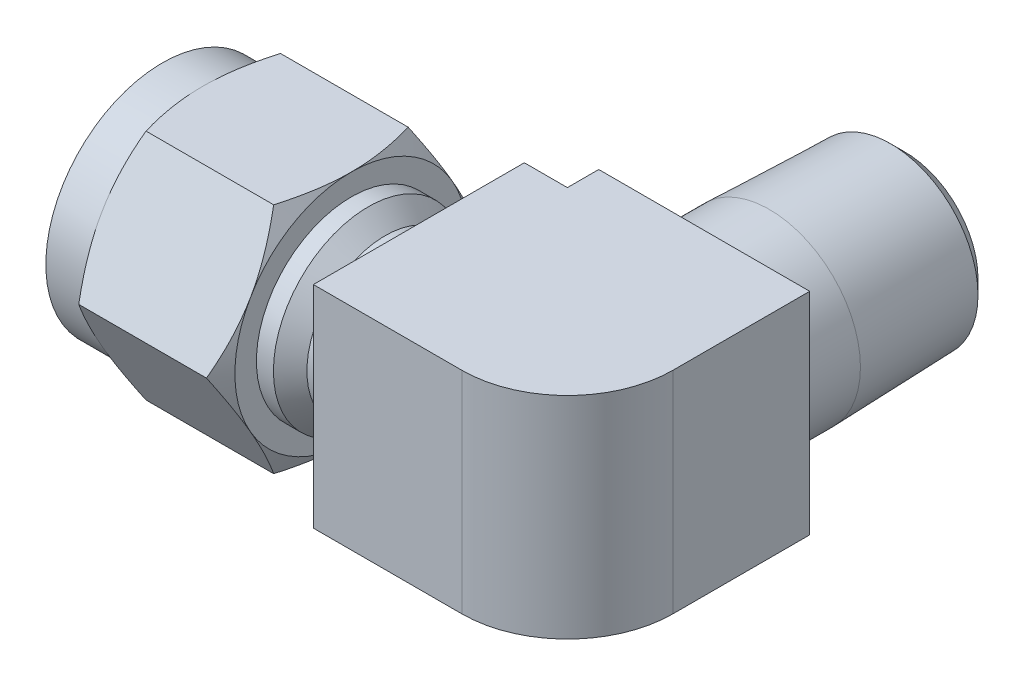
ISO-10303-21;
HEADER;
FILE_DESCRIPTION(('STEP AP214'),'2;1');
FILE_NAME('part.step','',(''),(''),'','','');
FILE_SCHEMA(('AUTOMOTIVE_DESIGN { 1 0 10303 214 1 1 1 1 }'));
ENDSEC;
DATA;
#1=APPLICATION_CONTEXT('core data for automotive mechanical design processes');
#2=APPLICATION_PROTOCOL_DEFINITION('international standard','automotive_design',2000,#1);
#3=PRODUCT_CONTEXT('',#1,'mechanical');
#4=PRODUCT('Part','Part','',(#3));
#5=PRODUCT_RELATED_PRODUCT_CATEGORY('part','',(#4));
#6=PRODUCT_DEFINITION_FORMATION('','',#4);
#7=PRODUCT_DEFINITION_CONTEXT('part definition',#1,'design');
#8=PRODUCT_DEFINITION('design','',#6,#7);
#9=PRODUCT_DEFINITION_SHAPE('','',#8);
#10=(LENGTH_UNIT() NAMED_UNIT(*) SI_UNIT(.MILLI.,.METRE.));
#11=(NAMED_UNIT(*) PLANE_ANGLE_UNIT() SI_UNIT($,.RADIAN.));
#12=(NAMED_UNIT(*) SI_UNIT($,.STERADIAN.) SOLID_ANGLE_UNIT());
#13=UNCERTAINTY_MEASURE_WITH_UNIT(LENGTH_MEASURE(1.E-05),#10,'distance_accuracy_value','');
#14=(GEOMETRIC_REPRESENTATION_CONTEXT(3) GLOBAL_UNCERTAINTY_ASSIGNED_CONTEXT((#13)) GLOBAL_UNIT_ASSIGNED_CONTEXT((#10,
#11,#12)) REPRESENTATION_CONTEXT('',''));
#15=CARTESIAN_POINT('',(0.,0.,0.));
#16=DIRECTION('',(0.,0.,1.));
#17=DIRECTION('',(1.,0.,0.));
#18=AXIS2_PLACEMENT_3D('',#15,#16,#17);
#19=CARTESIAN_POINT('',(0.,0.,4.3815));
#20=DIRECTION('',(-1.,0.,0.));
#21=DIRECTION('',(0.,0.,1.));
#22=AXIS2_PLACEMENT_3D('',#19,#20,#21);
#23=PLANE('',#22);
#24=CARTESIAN_POINT('',(0.,0.,0.));
#25=DIRECTION('',(1.,0.,0.));
#26=DIRECTION('',(0.,0.,-1.));
#27=AXIS2_PLACEMENT_3D('',#24,#25,#26);
#28=CIRCLE('',#27,8.763);
#29=CARTESIAN_POINT('',(0.,0.,-8.763));
#30=VERTEX_POINT('',#29);
#31=EDGE_CURVE('E862',#30,#30,#28,.T.);
#32=ORIENTED_EDGE('',*,*,#31,.F.);
#33=EDGE_LOOP('',(#32));
#34=FACE_BOUND('',#33,.T.);
#35=CARTESIAN_POINT('',(0.,0.,0.));
#36=DIRECTION('',(1.,0.,0.));
#37=DIRECTION('',(0.,0.,-1.));
#38=AXIS2_PLACEMENT_3D('',#35,#36,#37);
#39=CIRCLE('',#38,4.7625);
#40=CARTESIAN_POINT('',(0.,0.,-4.7625));
#41=VERTEX_POINT('',#40);
#42=EDGE_CURVE('E19',#41,#41,#39,.T.);
#43=ORIENTED_EDGE('',*,*,#42,.T.);
#44=EDGE_LOOP('',(#43));
#45=FACE_BOUND('',#44,.T.);
#46=ADVANCED_FACE('F16',(#34,#45),#23,.T.);
#47=CARTESIAN_POINT('',(8.382,0.,0.));
#48=DIRECTION('',(1.,0.,0.));
#49=DIRECTION('',(0.,0.,-1.));
#50=AXIS2_PLACEMENT_3D('',#47,#48,#49);
#51=CYLINDRICAL_SURFACE('',#50,4.7625);
#52=CARTESIAN_POINT('',(16.764,0.,0.));
#53=DIRECTION('',(1.,0.,0.));
#54=DIRECTION('',(0.,0.,-1.));
#55=AXIS2_PLACEMENT_3D('',#52,#53,#54);
#56=CIRCLE('',#55,4.7625);
#57=CARTESIAN_POINT('',(16.764,0.,-4.7625));
#58=VERTEX_POINT('',#57);
#59=EDGE_CURVE('E453',#58,#58,#56,.T.);
#60=ORIENTED_EDGE('',*,*,#59,.T.);
#61=EDGE_LOOP('',(#60));
#62=FACE_BOUND('',#61,.T.);
#63=ORIENTED_EDGE('',*,*,#42,.F.);
#64=EDGE_LOOP('',(#63));
#65=FACE_BOUND('',#64,.T.);
#66=ADVANCED_FACE('F833',(#62,#65),#51,.F.);
#67=CARTESIAN_POINT('',(8.636,0.,0.));
#68=DIRECTION('',(1.,0.,0.));
#69=DIRECTION('',(0.,0.,-1.));
#70=AXIS2_PLACEMENT_3D('',#67,#68,#69);
#71=CYLINDRICAL_SURFACE('',#70,8.763);
#72=CARTESIAN_POINT('',(3.048,0.,0.));
#73=DIRECTION('',(1.,0.,0.));
#74=DIRECTION('',(0.,0.,-1.));
#75=AXIS2_PLACEMENT_3D('',#72,#73,#74);
#76=CIRCLE('',#75,8.763);
#77=CARTESIAN_POINT('',(3.048,-8.763,0.));
#78=VERTEX_POINT('',#77);
#79=CARTESIAN_POINT('',(3.048,-4.3815,7.58898061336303));
#80=VERTEX_POINT('',#79);
#81=EDGE_CURVE('E449',#78,#80,#76,.F.);
#82=ORIENTED_EDGE('',*,*,#81,.T.);
#83=CARTESIAN_POINT('',(3.048,0.,0.));
#84=DIRECTION('',(1.,0.,0.));
#85=DIRECTION('',(0.,0.,-1.));
#86=AXIS2_PLACEMENT_3D('',#83,#84,#85);
#87=CIRCLE('',#86,8.763);
#88=CARTESIAN_POINT('',(3.048,4.3815,7.58898061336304));
#89=VERTEX_POINT('',#88);
#90=EDGE_CURVE('E461',#80,#89,#87,.F.);
#91=ORIENTED_EDGE('',*,*,#90,.T.);
#92=CARTESIAN_POINT('',(3.048,0.,0.));
#93=DIRECTION('',(1.,0.,0.));
#94=DIRECTION('',(0.,0.,-1.));
#95=AXIS2_PLACEMENT_3D('',#92,#93,#94);
#96=CIRCLE('',#95,8.763);
#97=CARTESIAN_POINT('',(3.048,8.763,0.));
#98=VERTEX_POINT('',#97);
#99=EDGE_CURVE('E466',#89,#98,#96,.F.);
#100=ORIENTED_EDGE('',*,*,#99,.T.);
#101=CARTESIAN_POINT('',(3.048,0.,0.));
#102=DIRECTION('',(1.,0.,0.));
#103=DIRECTION('',(0.,0.,-1.));
#104=AXIS2_PLACEMENT_3D('',#101,#102,#103);
#105=CIRCLE('',#104,8.763);
#106=CARTESIAN_POINT('',(3.048,4.3815,-7.58898061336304));
#107=VERTEX_POINT('',#106);
#108=EDGE_CURVE('E469',#98,#107,#105,.F.);
#109=ORIENTED_EDGE('',*,*,#108,.T.);
#110=CARTESIAN_POINT('',(3.048,0.,0.));
#111=DIRECTION('',(1.,0.,0.));
#112=DIRECTION('',(0.,0.,-1.));
#113=AXIS2_PLACEMENT_3D('',#110,#111,#112);
#114=CIRCLE('',#113,8.763);
#115=CARTESIAN_POINT('',(3.048,-4.3815,-7.58898061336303));
#116=VERTEX_POINT('',#115);
#117=EDGE_CURVE('E456',#107,#116,#114,.F.);
#118=ORIENTED_EDGE('',*,*,#117,.T.);
#119=CARTESIAN_POINT('',(3.048,0.,0.));
#120=DIRECTION('',(1.,0.,0.));
#121=DIRECTION('',(0.,0.,-1.));
#122=AXIS2_PLACEMENT_3D('',#119,#120,#121);
#123=CIRCLE('',#122,8.763);
#124=EDGE_CURVE('E452',#116,#78,#123,.F.);
#125=ORIENTED_EDGE('',*,*,#124,.T.);
#126=EDGE_LOOP('',(#82,#91,#100,#109,#118,#125));
#127=FACE_BOUND('',#126,.T.);
#128=ORIENTED_EDGE('',*,*,#31,.T.);
#129=EDGE_LOOP('',(#128));
#130=FACE_BOUND('',#129,.T.);
#131=ADVANCED_FACE('F589',(#127,#130),#71,.T.);
#132=CARTESIAN_POINT('',(16.764,0.,0.));
#133=DIRECTION('',(1.,0.,0.));
#134=DIRECTION('',(0.,1.,0.));
#135=AXIS2_PLACEMENT_3D('',#132,#133,#134);
#136=PLANE('',#135);
#137=ORIENTED_EDGE('',*,*,#59,.F.);
#138=EDGE_LOOP('',(#137));
#139=FACE_BOUND('',#138,.T.);
#140=CARTESIAN_POINT('',(16.764,0.,0.));
#141=DIRECTION('',(1.,0.,0.));
#142=DIRECTION('',(0.,0.,-1.));
#143=AXIS2_PLACEMENT_3D('',#140,#141,#142);
#144=CIRCLE('',#143,3.556);
#145=CARTESIAN_POINT('',(16.764,0.,-3.556));
#146=VERTEX_POINT('',#145);
#147=EDGE_CURVE('E162',#146,#146,#144,.T.);
#148=ORIENTED_EDGE('',*,*,#147,.T.);
#149=EDGE_LOOP('',(#148));
#150=FACE_BOUND('',#149,.T.);
#151=ADVANCED_FACE('F819',(#139,#150),#136,.F.);
#152=CARTESIAN_POINT('',(3.048,0.,0.));
#153=DIRECTION('',(1.,0.,0.));
#154=DIRECTION('',(0.,0.,-1.));
#155=AXIS2_PLACEMENT_3D('',#152,#153,#154);
#156=CONICAL_SURFACE('',#155,8.763,1.0471975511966);
#157=CARTESIAN_POINT('',(3.048,-4.3815,7.58898061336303));
#158=CARTESIAN_POINT('',(3.04796418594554,-4.56747009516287,7.48161072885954));
#159=CARTESIAN_POINT('',(3.05255639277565,-4.75343123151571,7.37424601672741));
#160=CARTESIAN_POINT('',(3.07073065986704,-5.12498836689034,7.15972740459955));
#161=CARTESIAN_POINT('',(3.08431094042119,-5.31058443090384,7.05257346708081));
#162=CARTESIAN_POINT('',(3.12010574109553,-5.68021261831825,6.83916853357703));
#163=CARTESIAN_POINT('',(3.14227679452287,-5.86424792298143,6.73291570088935));
#164=CARTESIAN_POINT('',(3.19477623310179,-6.23144172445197,6.52091626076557));
#165=CARTESIAN_POINT('',(3.2251048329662,-6.4146001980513,6.41516966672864));
#166=CARTESIAN_POINT('',(3.32739002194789,-6.96200116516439,6.09912757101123));
#167=CARTESIAN_POINT('',(3.41069566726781,-7.324653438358,5.88975018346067));
#168=CARTESIAN_POINT('',(3.60281979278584,-8.04683933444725,5.47279596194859));
#169=CARTESIAN_POINT('',(3.7117656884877,-8.40634776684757,5.26523367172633));
#170=CARTESIAN_POINT('',(3.83067959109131,-8.763,5.05932040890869));
#171=B_SPLINE_CURVE_WITH_KNOTS('',3,(#157,#158,#159,#160,#161,#162,#163,#164,#165,#166,#167,
#168,#169,#170),.UNSPECIFIED.,.F.,.F.,(4,2,2,2,2,2,4),(0.,0.644153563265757,1.28817961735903,
1.92898877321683,2.5698147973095,3.84978725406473,5.13625990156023),.UNSPECIFIED.);
#172=CARTESIAN_POINT('',(3.83067959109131,-8.763,5.05932040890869));
#173=VERTEX_POINT('',#172);
#174=EDGE_CURVE('E328',#80,#173,#171,.T.);
#175=ORIENTED_EDGE('',*,*,#174,.F.);
#176=ORIENTED_EDGE('',*,*,#81,.F.);
#177=CARTESIAN_POINT('',(3.83067959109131,-8.763,5.05932040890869));
#178=CARTESIAN_POINT('',(3.7117656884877,-8.763,4.64749388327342));
#179=CARTESIAN_POINT('',(3.60281979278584,-8.763,4.23236930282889));
#180=CARTESIAN_POINT('',(3.41069566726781,-8.763,3.39846085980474));
#181=CARTESIAN_POINT('',(3.32739002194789,-8.763,2.97970608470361));
#182=CARTESIAN_POINT('',(3.2251048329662,-8.763,2.3476218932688));
#183=CARTESIAN_POINT('',(3.19477623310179,-8.763,2.13612870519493));
#184=CARTESIAN_POINT('',(3.14227679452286,-8.763,1.71212982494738));
#185=CARTESIAN_POINT('',(3.12010574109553,-8.763,1.49962415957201));
#186=CARTESIAN_POINT('',(3.08431094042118,-8.763,1.07281429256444));
#187=CARTESIAN_POINT('',(3.07073065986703,-8.76299999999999,0.858506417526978));
#188=CARTESIAN_POINT('',(3.05255639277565,-8.76299999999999,0.429469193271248));
#189=CARTESIAN_POINT('',(3.04796418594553,-8.76299999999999,0.214739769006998));
#190=CARTESIAN_POINT('',(3.048,-8.76299999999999,0.));
#191=B_SPLINE_CURVE_WITH_KNOTS('',3,(#177,#178,#179,#180,#181,#182,#183,#184,#185,#186,#187,
#188,#189,#190),.UNSPECIFIED.,.F.,.F.,(4,2,2,2,2,2,4),(0.,1.2864726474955,2.56644510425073,
3.2072711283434,3.8480802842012,4.49210633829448,5.13625990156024),.UNSPECIFIED.);
#192=EDGE_CURVE('E329',#173,#78,#191,.T.);
#193=ORIENTED_EDGE('',*,*,#192,.F.);
#194=EDGE_LOOP('',(#175,#176,#193));
#195=FACE_BOUND('',#194,.T.);
#196=ADVANCED_FACE('F311',(#195),#156,.T.);
#197=CARTESIAN_POINT('',(3.048,0.,0.));
#198=DIRECTION('',(1.,0.,0.));
#199=DIRECTION('',(0.,0.,-1.));
#200=AXIS2_PLACEMENT_3D('',#197,#198,#199);
#201=CONICAL_SURFACE('',#200,8.763,1.0471975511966);
#202=ORIENTED_EDGE('',*,*,#124,.F.);
#203=CARTESIAN_POINT('',(3.83067959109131,-8.763,-5.05932040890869));
#204=CARTESIAN_POINT('',(3.7117656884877,-8.40634776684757,-5.26523367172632));
#205=CARTESIAN_POINT('',(3.60281979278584,-8.04683933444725,-5.47279596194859));
#206=CARTESIAN_POINT('',(3.41069566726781,-7.324653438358,-5.88975018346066));
#207=CARTESIAN_POINT('',(3.32739002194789,-6.96200116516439,-6.09912757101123));
#208=CARTESIAN_POINT('',(3.2251048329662,-6.4146001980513,-6.41516966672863));
#209=CARTESIAN_POINT('',(3.19477623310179,-6.23144172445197,-6.52091626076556));
#210=CARTESIAN_POINT('',(3.14227679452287,-5.86424792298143,-6.73291570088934));
#211=CARTESIAN_POINT('',(3.12010574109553,-5.68021261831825,-6.83916853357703));
#212=CARTESIAN_POINT('',(3.08431094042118,-5.31058443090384,-7.05257346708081));
#213=CARTESIAN_POINT('',(3.07073065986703,-5.12498836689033,-7.15972740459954));
#214=CARTESIAN_POINT('',(3.05255639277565,-4.75343123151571,-7.37424601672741));
#215=CARTESIAN_POINT('',(3.04796418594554,-4.56747009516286,-7.48161072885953));
#216=CARTESIAN_POINT('',(3.048,-4.3815,-7.58898061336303));
#217=B_SPLINE_CURVE_WITH_KNOTS('',3,(#203,#204,#205,#206,#207,#208,#209,#210,#211,#212,#213,
#214,#215,#216),.UNSPECIFIED.,.F.,.F.,(4,2,2,2,2,2,4),(0.,1.2864726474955,2.56644510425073,
3.2072711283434,3.8480802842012,4.49210633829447,5.13625990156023),.UNSPECIFIED.);
#218=CARTESIAN_POINT('',(3.83067959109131,-8.76299999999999,-5.05932040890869));
#219=VERTEX_POINT('',#218);
#220=EDGE_CURVE('E316',#219,#116,#217,.T.);
#221=ORIENTED_EDGE('',*,*,#220,.F.);
#222=CARTESIAN_POINT('',(3.048,-8.76299999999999,0.));
#223=CARTESIAN_POINT('',(3.04796418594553,-8.76299999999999,-0.214739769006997));
#224=CARTESIAN_POINT('',(3.05255639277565,-8.76299999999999,-0.429469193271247));
#225=CARTESIAN_POINT('',(3.07073065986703,-8.76299999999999,-0.858506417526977));
#226=CARTESIAN_POINT('',(3.08431094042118,-8.76299999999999,-1.07281429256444));
#227=CARTESIAN_POINT('',(3.12010574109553,-8.76299999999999,-1.49962415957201));
#228=CARTESIAN_POINT('',(3.14227679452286,-8.76299999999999,-1.71212982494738));
#229=CARTESIAN_POINT('',(3.19477623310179,-8.76299999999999,-2.13612870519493));
#230=CARTESIAN_POINT('',(3.2251048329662,-8.76299999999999,-2.34762189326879));
#231=CARTESIAN_POINT('',(3.32739002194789,-8.76299999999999,-2.9797060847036));
#232=CARTESIAN_POINT('',(3.41069566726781,-8.76299999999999,-3.39846085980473));
#233=CARTESIAN_POINT('',(3.60281979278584,-8.76299999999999,-4.23236930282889));
#234=CARTESIAN_POINT('',(3.7117656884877,-8.76299999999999,-4.64749388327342));
#235=CARTESIAN_POINT('',(3.83067959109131,-8.76299999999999,-5.05932040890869));
#236=B_SPLINE_CURVE_WITH_KNOTS('',3,(#222,#223,#224,#225,#226,#227,#228,#229,#230,#231,#232,
#233,#234,#235),.UNSPECIFIED.,.F.,.F.,(4,2,2,2,2,2,4),(0.,0.644153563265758,1.28817961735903,
1.92898877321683,2.56981479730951,3.84978725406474,5.13625990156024),.UNSPECIFIED.);
#237=EDGE_CURVE('E322',#78,#219,#236,.T.);
#238=ORIENTED_EDGE('',*,*,#237,.F.);
#239=EDGE_LOOP('',(#202,#221,#238));
#240=FACE_BOUND('',#239,.T.);
#241=ADVANCED_FACE('F304',(#240),#201,.T.);
#242=CARTESIAN_POINT('',(3.048,0.,0.));
#243=DIRECTION('',(1.,0.,0.));
#244=DIRECTION('',(0.,0.,-1.));
#245=AXIS2_PLACEMENT_3D('',#242,#243,#244);
#246=CONICAL_SURFACE('',#245,8.763,1.0471975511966);
#247=ORIENTED_EDGE('',*,*,#117,.F.);
#248=CARTESIAN_POINT('',(3.83067959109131,0.,-10.1186408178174));
#249=CARTESIAN_POINT('',(3.7117656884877,0.356652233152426,-9.91272755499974));
#250=CARTESIAN_POINT('',(3.60281979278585,0.716160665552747,-9.70516526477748));
#251=CARTESIAN_POINT('',(3.41069566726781,1.43834656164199,-9.2882110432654));
#252=CARTESIAN_POINT('',(3.32739002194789,1.80099883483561,-9.07883365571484));
#253=CARTESIAN_POINT('',(3.22510483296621,2.3483998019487,-8.76279155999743));
#254=CARTESIAN_POINT('',(3.19477623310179,2.53155827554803,-8.6570449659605));
#255=CARTESIAN_POINT('',(3.14227679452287,2.89875207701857,-8.44504552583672));
#256=CARTESIAN_POINT('',(3.12010574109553,3.08278738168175,-8.33879269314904));
#257=CARTESIAN_POINT('',(3.08431094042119,3.45241556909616,-8.12538775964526));
#258=CARTESIAN_POINT('',(3.07073065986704,3.63801163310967,-8.01823382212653));
#259=CARTESIAN_POINT('',(3.05255639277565,4.00956876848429,-7.80371520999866));
#260=CARTESIAN_POINT('',(3.04796418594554,4.19552990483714,-7.69635049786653));
#261=CARTESIAN_POINT('',(3.048,4.3815,-7.58898061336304));
#262=B_SPLINE_CURVE_WITH_KNOTS('',3,(#248,#249,#250,#251,#252,#253,#254,#255,#256,#257,#258,
#259,#260,#261),.UNSPECIFIED.,.F.,.F.,(4,2,2,2,2,2,4),(0.,1.2864726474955,2.56644510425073,
3.2072711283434,3.8480802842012,4.49210633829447,5.13625990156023),.UNSPECIFIED.);
#263=CARTESIAN_POINT('',(3.83067959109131,0.,-10.1186408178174));
#264=VERTEX_POINT('',#263);
#265=EDGE_CURVE('E285',#264,#107,#262,.T.);
#266=ORIENTED_EDGE('',*,*,#265,.F.);
#267=CARTESIAN_POINT('',(3.048,-4.3815,-7.58898061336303));
#268=CARTESIAN_POINT('',(3.04796418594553,-4.19552990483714,-7.69635049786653));
#269=CARTESIAN_POINT('',(3.05255639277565,-4.00956876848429,-7.80371520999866));
#270=CARTESIAN_POINT('',(3.07073065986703,-3.63801163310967,-8.01823382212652));
#271=CARTESIAN_POINT('',(3.08431094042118,-3.45241556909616,-8.12538775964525));
#272=CARTESIAN_POINT('',(3.12010574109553,-3.08278738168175,-8.33879269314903));
#273=CARTESIAN_POINT('',(3.14227679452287,-2.89875207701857,-8.44504552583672));
#274=CARTESIAN_POINT('',(3.19477623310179,-2.53155827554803,-8.6570449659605));
#275=CARTESIAN_POINT('',(3.2251048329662,-2.3483998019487,-8.76279155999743));
#276=CARTESIAN_POINT('',(3.32739002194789,-1.80099883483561,-9.07883365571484));
#277=CARTESIAN_POINT('',(3.41069566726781,-1.438346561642,-9.2882110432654));
#278=CARTESIAN_POINT('',(3.60281979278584,-0.716160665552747,-9.70516526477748));
#279=CARTESIAN_POINT('',(3.7117656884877,-0.356652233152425,-9.91272755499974));
#280=CARTESIAN_POINT('',(3.83067959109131,0.,-10.1186408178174));
#281=B_SPLINE_CURVE_WITH_KNOTS('',3,(#267,#268,#269,#270,#271,#272,#273,#274,#275,#276,#277,
#278,#279,#280),.UNSPECIFIED.,.F.,.F.,(4,2,2,2,2,2,4),(0.,0.644153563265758,1.28817961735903,
1.92898877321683,2.56981479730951,3.84978725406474,5.13625990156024),.UNSPECIFIED.);
#282=EDGE_CURVE('E293',#116,#264,#281,.T.);
#283=ORIENTED_EDGE('',*,*,#282,.F.);
#284=EDGE_LOOP('',(#247,#266,#283));
#285=FACE_BOUND('',#284,.T.);
#286=ADVANCED_FACE('F298',(#285),#246,.T.);
#287=CARTESIAN_POINT('',(3.048,0.,0.));
#288=DIRECTION('',(1.,0.,0.));
#289=DIRECTION('',(0.,0.,-1.));
#290=AXIS2_PLACEMENT_3D('',#287,#288,#289);
#291=CONICAL_SURFACE('',#290,8.763,1.0471975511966);
#292=CARTESIAN_POINT('',(3.048,4.3815,7.58898061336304));
#293=CARTESIAN_POINT('',(3.04796418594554,4.19552990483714,7.69635049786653));
#294=CARTESIAN_POINT('',(3.05255639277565,4.00956876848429,7.80371520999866));
#295=CARTESIAN_POINT('',(3.07073065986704,3.63801163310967,8.01823382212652));
#296=CARTESIAN_POINT('',(3.08431094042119,3.45241556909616,8.12538775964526));
#297=CARTESIAN_POINT('',(3.12010574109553,3.08278738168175,8.33879269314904));
#298=CARTESIAN_POINT('',(3.14227679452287,2.89875207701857,8.44504552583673));
#299=CARTESIAN_POINT('',(3.19477623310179,2.53155827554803,8.6570449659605));
#300=CARTESIAN_POINT('',(3.22510483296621,2.3483998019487,8.76279155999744));
#301=CARTESIAN_POINT('',(3.32739002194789,1.80099883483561,9.07883365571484));
#302=CARTESIAN_POINT('',(3.41069566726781,1.43834656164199,9.2882110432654));
#303=CARTESIAN_POINT('',(3.60281979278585,0.716160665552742,9.70516526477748));
#304=CARTESIAN_POINT('',(3.7117656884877,0.356652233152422,9.91272755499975));
#305=CARTESIAN_POINT('',(3.83067959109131,0.,10.1186408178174));
#306=B_SPLINE_CURVE_WITH_KNOTS('',3,(#292,#293,#294,#295,#296,#297,#298,#299,#300,#301,#302,
#303,#304,#305),.UNSPECIFIED.,.F.,.F.,(4,2,2,2,2,2,4),(0.,0.64415356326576,1.28817961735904,
1.92898877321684,2.56981479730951,3.84978725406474,5.13625990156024),.UNSPECIFIED.);
#307=CARTESIAN_POINT('',(3.83067959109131,0.,10.1186408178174));
#308=VERTEX_POINT('',#307);
#309=EDGE_CURVE('E566',#89,#308,#306,.T.);
#310=ORIENTED_EDGE('',*,*,#309,.F.);
#311=ORIENTED_EDGE('',*,*,#90,.F.);
#312=CARTESIAN_POINT('',(3.83067959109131,0.,10.1186408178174));
#313=CARTESIAN_POINT('',(3.7117656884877,-0.35665223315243,9.91272755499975));
#314=CARTESIAN_POINT('',(3.60281979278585,-0.716160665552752,9.70516526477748));
#315=CARTESIAN_POINT('',(3.41069566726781,-1.438346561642,9.2882110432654));
#316=CARTESIAN_POINT('',(3.32739002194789,-1.80099883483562,9.07883365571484));
#317=CARTESIAN_POINT('',(3.22510483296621,-2.34839980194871,8.76279155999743));
#318=CARTESIAN_POINT('',(3.19477623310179,-2.53155827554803,8.6570449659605));
#319=CARTESIAN_POINT('',(3.14227679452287,-2.89875207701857,8.44504552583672));
#320=CARTESIAN_POINT('',(3.12010574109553,-3.08278738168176,8.33879269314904));
#321=CARTESIAN_POINT('',(3.08431094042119,-3.45241556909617,8.12538775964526));
#322=CARTESIAN_POINT('',(3.07073065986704,-3.63801163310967,8.01823382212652));
#323=CARTESIAN_POINT('',(3.05255639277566,-4.00956876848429,7.80371520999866));
#324=CARTESIAN_POINT('',(3.04796418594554,-4.19552990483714,7.69635049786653));
#325=CARTESIAN_POINT('',(3.048,-4.3815,7.58898061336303));
#326=B_SPLINE_CURVE_WITH_KNOTS('',3,(#312,#313,#314,#315,#316,#317,#318,#319,#320,#321,#322,
#323,#324,#325),.UNSPECIFIED.,.F.,.F.,(4,2,2,2,2,2,4),(0.,1.2864726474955,2.56644510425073,
3.2072711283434,3.8480802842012,4.49210633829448,5.13625990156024),.UNSPECIFIED.);
#327=EDGE_CURVE('E161',#308,#80,#326,.T.);
#328=ORIENTED_EDGE('',*,*,#327,.F.);
#329=EDGE_LOOP('',(#310,#311,#328));
#330=FACE_BOUND('',#329,.T.);
#331=ADVANCED_FACE('F303',(#330),#291,.T.);
#332=CARTESIAN_POINT('',(3.048,0.,0.));
#333=DIRECTION('',(1.,0.,0.));
#334=DIRECTION('',(0.,0.,-1.));
#335=AXIS2_PLACEMENT_3D('',#332,#333,#334);
#336=CONICAL_SURFACE('',#335,8.763,1.0471975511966);
#337=CARTESIAN_POINT('',(3.048,8.763,0.));
#338=CARTESIAN_POINT('',(3.04796418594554,8.763,0.214739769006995));
#339=CARTESIAN_POINT('',(3.05255639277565,8.763,0.429469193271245));
#340=CARTESIAN_POINT('',(3.07073065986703,8.763,0.858506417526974));
#341=CARTESIAN_POINT('',(3.08431094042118,8.763,1.07281429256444));
#342=CARTESIAN_POINT('',(3.12010574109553,8.763,1.499624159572));
#343=CARTESIAN_POINT('',(3.14227679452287,8.763,1.71212982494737));
#344=CARTESIAN_POINT('',(3.19477623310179,8.763,2.13612870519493));
#345=CARTESIAN_POINT('',(3.2251048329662,8.763,2.34762189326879));
#346=CARTESIAN_POINT('',(3.32739002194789,8.763,2.9797060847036));
#347=CARTESIAN_POINT('',(3.41069566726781,8.763,3.39846085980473));
#348=CARTESIAN_POINT('',(3.60281979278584,8.763,4.23236930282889));
#349=CARTESIAN_POINT('',(3.7117656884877,8.763,4.64749388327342));
#350=CARTESIAN_POINT('',(3.83067959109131,8.763,5.05932040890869));
#351=B_SPLINE_CURVE_WITH_KNOTS('',3,(#337,#338,#339,#340,#341,#342,#343,#344,#345,#346,#347,
#348,#349,#350),.UNSPECIFIED.,.F.,.F.,(4,2,2,2,2,2,4),(0.,0.644153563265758,1.28817961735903,
1.92898877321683,2.56981479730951,3.84978725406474,5.13625990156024),.UNSPECIFIED.);
#352=CARTESIAN_POINT('',(3.83067959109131,8.763,5.05932040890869));
#353=VERTEX_POINT('',#352);
#354=EDGE_CURVE('E192',#98,#353,#351,.T.);
#355=ORIENTED_EDGE('',*,*,#354,.F.);
#356=ORIENTED_EDGE('',*,*,#99,.F.);
#357=CARTESIAN_POINT('',(3.83067959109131,8.763,5.05932040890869));
#358=CARTESIAN_POINT('',(3.7117656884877,8.40634776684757,5.26523367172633));
#359=CARTESIAN_POINT('',(3.60281979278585,8.04683933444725,5.47279596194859));
#360=CARTESIAN_POINT('',(3.41069566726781,7.324653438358,5.88975018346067));
#361=CARTESIAN_POINT('',(3.32739002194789,6.96200116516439,6.09912757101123));
#362=CARTESIAN_POINT('',(3.22510483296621,6.4146001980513,6.41516966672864));
#363=CARTESIAN_POINT('',(3.19477623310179,6.23144172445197,6.52091626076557));
#364=CARTESIAN_POINT('',(3.14227679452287,5.86424792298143,6.73291570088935));
#365=CARTESIAN_POINT('',(3.12010574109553,5.68021261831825,6.83916853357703));
#366=CARTESIAN_POINT('',(3.08431094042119,5.31058443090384,7.05257346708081));
#367=CARTESIAN_POINT('',(3.07073065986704,5.12498836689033,7.15972740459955));
#368=CARTESIAN_POINT('',(3.05255639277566,4.75343123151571,7.37424601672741));
#369=CARTESIAN_POINT('',(3.04796418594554,4.56747009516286,7.48161072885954));
#370=CARTESIAN_POINT('',(3.048,4.3815,7.58898061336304));
#371=B_SPLINE_CURVE_WITH_KNOTS('',3,(#357,#358,#359,#360,#361,#362,#363,#364,#365,#366,#367,
#368,#369,#370),.UNSPECIFIED.,.F.,.F.,(4,2,2,2,2,2,4),(0.,1.2864726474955,2.56644510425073,
3.2072711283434,3.8480802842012,4.49210633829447,5.13625990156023),.UNSPECIFIED.);
#372=EDGE_CURVE('E569',#353,#89,#371,.T.);
#373=ORIENTED_EDGE('',*,*,#372,.F.);
#374=EDGE_LOOP('',(#355,#356,#373));
#375=FACE_BOUND('',#374,.T.);
#376=ADVANCED_FACE('F482',(#375),#336,.T.);
#377=CARTESIAN_POINT('',(3.048,0.,0.));
#378=DIRECTION('',(1.,0.,0.));
#379=DIRECTION('',(0.,0.,-1.));
#380=AXIS2_PLACEMENT_3D('',#377,#378,#379);
#381=CONICAL_SURFACE('',#380,8.763,1.0471975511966);
#382=ORIENTED_EDGE('',*,*,#108,.F.);
#383=CARTESIAN_POINT('',(3.83067959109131,8.763,-5.05932040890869));
#384=CARTESIAN_POINT('',(3.7117656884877,8.763,-4.64749388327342));
#385=CARTESIAN_POINT('',(3.60281979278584,8.763,-4.23236930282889));
#386=CARTESIAN_POINT('',(3.41069566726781,8.763,-3.39846085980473));
#387=CARTESIAN_POINT('',(3.32739002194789,8.763,-2.9797060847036));
#388=CARTESIAN_POINT('',(3.22510483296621,8.763,-2.34762189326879));
#389=CARTESIAN_POINT('',(3.19477623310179,8.763,-2.13612870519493));
#390=CARTESIAN_POINT('',(3.14227679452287,8.763,-1.71212982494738));
#391=CARTESIAN_POINT('',(3.12010574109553,8.763,-1.49962415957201));
#392=CARTESIAN_POINT('',(3.08431094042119,8.763,-1.07281429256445));
#393=CARTESIAN_POINT('',(3.07073065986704,8.763,-0.858506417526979));
#394=CARTESIAN_POINT('',(3.05255639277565,8.763,-0.42946919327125));
#395=CARTESIAN_POINT('',(3.04796418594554,8.763,-0.214739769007));
#396=CARTESIAN_POINT('',(3.048,8.763,0.));
#397=B_SPLINE_CURVE_WITH_KNOTS('',3,(#383,#384,#385,#386,#387,#388,#389,#390,#391,#392,#393,
#394,#395,#396),.UNSPECIFIED.,.F.,.F.,(4,2,2,2,2,2,4),(0.,1.2864726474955,2.56644510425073,
3.2072711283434,3.8480802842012,4.49210633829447,5.13625990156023),.UNSPECIFIED.);
#398=CARTESIAN_POINT('',(3.83067959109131,8.763,-5.05932040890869));
#399=VERTEX_POINT('',#398);
#400=EDGE_CURVE('E167',#399,#98,#397,.T.);
#401=ORIENTED_EDGE('',*,*,#400,.F.);
#402=CARTESIAN_POINT('',(3.048,4.3815,-7.58898061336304));
#403=CARTESIAN_POINT('',(3.04796418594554,4.56747009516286,-7.48161072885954));
#404=CARTESIAN_POINT('',(3.05255639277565,4.75343123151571,-7.37424601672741));
#405=CARTESIAN_POINT('',(3.07073065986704,5.12498836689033,-7.15972740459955));
#406=CARTESIAN_POINT('',(3.08431094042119,5.31058443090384,-7.05257346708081));
#407=CARTESIAN_POINT('',(3.12010574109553,5.68021261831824,-6.83916853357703));
#408=CARTESIAN_POINT('',(3.14227679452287,5.86424792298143,-6.73291570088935));
#409=CARTESIAN_POINT('',(3.19477623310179,6.23144172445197,-6.52091626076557));
#410=CARTESIAN_POINT('',(3.22510483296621,6.4146001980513,-6.41516966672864));
#411=CARTESIAN_POINT('',(3.32739002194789,6.96200116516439,-6.09912757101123));
#412=CARTESIAN_POINT('',(3.41069566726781,7.32465343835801,-5.88975018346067));
#413=CARTESIAN_POINT('',(3.60281979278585,8.04683933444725,-5.47279596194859));
#414=CARTESIAN_POINT('',(3.7117656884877,8.40634776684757,-5.26523367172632));
#415=CARTESIAN_POINT('',(3.83067959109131,8.763,-5.05932040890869));
#416=B_SPLINE_CURVE_WITH_KNOTS('',3,(#402,#403,#404,#405,#406,#407,#408,#409,#410,#411,#412,
#413,#414,#415),.UNSPECIFIED.,.F.,.F.,(4,2,2,2,2,2,4),(0.,0.644153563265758,1.28817961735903,
1.92898877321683,2.56981479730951,3.84978725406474,5.13625990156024),.UNSPECIFIED.);
#417=EDGE_CURVE('E278',#107,#399,#416,.T.);
#418=ORIENTED_EDGE('',*,*,#417,.F.);
#419=EDGE_LOOP('',(#382,#401,#418));
#420=FACE_BOUND('',#419,.T.);
#421=ADVANCED_FACE('F198',(#420),#381,.T.);
#422=CARTESIAN_POINT('',(24.892,0.,0.));
#423=DIRECTION('',(1.,0.,0.));
#424=DIRECTION('',(0.,0.,-1.));
#425=AXIS2_PLACEMENT_3D('',#422,#423,#424);
#426=CYLINDRICAL_SURFACE('',#425,3.556);
#427=CARTESIAN_POINT('',(30.48,0.,0.));
#428=DIRECTION('',(1.,0.,0.));
#429=DIRECTION('',(0.,0.,-1.));
#430=AXIS2_PLACEMENT_3D('',#427,#428,#429);
#431=CIRCLE('',#430,3.556);
#432=CARTESIAN_POINT('',(30.48,3.556,0.));
#433=VERTEX_POINT('',#432);
#434=CARTESIAN_POINT('',(30.48,-3.556,0.));
#435=VERTEX_POINT('',#434);
#436=EDGE_CURVE('E153',#433,#435,#431,.T.);
#437=ORIENTED_EDGE('',*,*,#436,.T.);
#438=CARTESIAN_POINT('',(30.48,0.,0.));
#439=DIRECTION('',(0.707106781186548,0.,-0.707106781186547));
#440=DIRECTION('',(0.707106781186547,0.,0.707106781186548));
#441=AXIS2_PLACEMENT_3D('',#438,#439,#440);
#442=ELLIPSE('',#441,5.02894342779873,3.556);
#443=EDGE_CURVE('E160',#435,#433,#442,.T.);
#444=ORIENTED_EDGE('',*,*,#443,.T.);
#445=EDGE_LOOP('',(#437,#444));
#446=FACE_BOUND('',#445,.T.);
#447=ORIENTED_EDGE('',*,*,#147,.F.);
#448=EDGE_LOOP('',(#447));
#449=FACE_BOUND('',#448,.T.);
#450=ADVANCED_FACE('F158',(#446,#449),#426,.F.);
#451=CARTESIAN_POINT('',(30.48,0.,0.));
#452=DIRECTION('',(0.72877728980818,0.154526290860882,0.667087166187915));
#453=DIRECTION('',(0.289441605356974,0.813376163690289,-0.504621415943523));
#454=AXIS2_PLACEMENT_3D('',#451,#452,#453);
#455=SPHERICAL_SURFACE('',#454,3.556);
#456=CARTESIAN_POINT('',(33.0715320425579,0.549495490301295,2.37216196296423));
#457=VERTEX_POINT('',#456);
#458=VERTEX_LOOP('',#457);
#459=FACE_BOUND('',#458,.T.);
#460=ORIENTED_EDGE('',*,*,#436,.F.);
#461=CARTESIAN_POINT('',(30.48,0.,0.));
#462=DIRECTION('',(0.,0.,-1.));
#463=DIRECTION('',(-1.,0.,0.));
#464=AXIS2_PLACEMENT_3D('',#461,#462,#463);
#465=CIRCLE('',#464,3.556);
#466=EDGE_CURVE('E166',#433,#435,#465,.T.);
#467=ORIENTED_EDGE('',*,*,#466,.T.);
#468=EDGE_LOOP('',(#460,#467));
#469=FACE_BOUND('',#468,.T.);
#470=ADVANCED_FACE('F169',(#459,#469),#455,.F.);
#471=CARTESIAN_POINT('',(14.224,0.,10.1186408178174));
#472=DIRECTION('',(0.,-0.5,0.866025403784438));
#473=DIRECTION('',(0.,-0.866025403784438,-0.5));
#474=AXIS2_PLACEMENT_3D('',#471,#472,#473);
#475=PLANE('',#474);
#476=CARTESIAN_POINT('',(14.224,-4.38150000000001,7.58898061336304));
#477=CARTESIAN_POINT('',(14.2240358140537,-4.19552990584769,7.69635049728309));
#478=CARTESIAN_POINT('',(14.2194436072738,-4.00956877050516,7.80371520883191));
#479=CARTESIAN_POINT('',(14.2012693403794,-3.6380116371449,8.01823381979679));
#480=CARTESIAN_POINT('',(14.1876890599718,-3.45241557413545,8.12538775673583));
#481=CARTESIAN_POINT('',(14.1518942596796,-3.08278738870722,8.33879268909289));
#482=CARTESIAN_POINT('',(14.129723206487,-2.89875208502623,8.4450455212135));
#483=CARTESIAN_POINT('',(14.0772237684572,-2.53155828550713,8.65704496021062));
#484=CARTESIAN_POINT('',(14.046895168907,-2.34839981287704,8.76279155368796));
#485=CARTESIAN_POINT('',(13.944609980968,-1.80099884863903,9.07883364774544));
#486=CARTESIAN_POINT('',(13.8613043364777,-1.43834657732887,9.28821103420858));
#487=CARTESIAN_POINT('',(13.6691802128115,-0.716160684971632,9.70516525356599));
#488=CARTESIAN_POINT('',(13.5602343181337,-0.356652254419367,9.91272754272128));
#489=CARTESIAN_POINT('',(13.4413204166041,-2.30861681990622E-08,10.1186408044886));
#490=B_SPLINE_CURVE_WITH_KNOTS('',3,(#476,#477,#478,#479,#480,#481,#482,#483,#484,#485,#486,
#487,#488,#489),.UNSPECIFIED.,.F.,.F.,(4,2,2,2,2,2,4),(0.,0.644153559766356,1.28817961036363,
1.92898876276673,2.56981478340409,3.84978723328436,5.1362598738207),.UNSPECIFIED.);
#491=CARTESIAN_POINT('',(14.224,-4.3815,7.58898061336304));
#492=VERTEX_POINT('',#491);
#493=CARTESIAN_POINT('',(13.4413204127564,1.15430780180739E-08,10.118640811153));
#494=VERTEX_POINT('',#493);
#495=EDGE_CURVE('E173',#492,#494,#490,.T.);
#496=ORIENTED_EDGE('',*,*,#495,.T.);
#497=DIRECTION('',(1.,0.,0.));
#498=VECTOR('',#497,1.);
#499=CARTESIAN_POINT('',(14.224,0.,10.1186408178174));
#500=LINE('',#499,#498);
#501=EDGE_CURVE('E562',#308,#494,#500,.T.);
#502=ORIENTED_EDGE('',*,*,#501,.F.);
#503=ORIENTED_EDGE('',*,*,#327,.T.);
#504=ORIENTED_EDGE('',*,*,#174,.T.);
#505=DIRECTION('',(1.,0.,0.));
#506=VECTOR('',#505,1.);
#507=CARTESIAN_POINT('',(14.224,-8.763,5.05932040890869));
#508=LINE('',#507,#506);
#509=CARTESIAN_POINT('',(13.4413204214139,-8.76299996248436,5.05932043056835));
#510=VERTEX_POINT('',#509);
#511=EDGE_CURVE('E327',#510,#173,#508,.F.);
#512=ORIENTED_EDGE('',*,*,#511,.F.);
#513=CARTESIAN_POINT('',(13.4413204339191,-8.76299992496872,5.05932045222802));
#514=CARTESIAN_POINT('',(13.5602343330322,-8.40634769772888,5.26523371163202));
#515=CARTESIAN_POINT('',(13.6691802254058,-8.04683927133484,5.47279599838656));
#516=CARTESIAN_POINT('',(13.8613043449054,-7.32465338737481,5.88975021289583));
#517=CARTESIAN_POINT('',(13.9446099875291,-6.96200112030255,6.09912759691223));
#518=CARTESIAN_POINT('',(14.0468951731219,-6.41460016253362,6.41516968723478));
#519=CARTESIAN_POINT('',(14.0772237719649,-6.23144169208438,6.52091627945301));
#520=CARTESIAN_POINT('',(14.1297232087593,-5.86424789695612,6.73291571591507));
#521=CARTESIAN_POINT('',(14.1518942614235,-5.68021259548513,6.83916854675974));
#522=CARTESIAN_POINT('',(14.187689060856,-5.31058441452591,7.05257347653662));
#523=CARTESIAN_POINT('',(14.2012693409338,-5.12498835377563,7.15972741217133));
#524=CARTESIAN_POINT('',(14.2194436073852,-4.7534312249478,7.3742460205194));
#525=CARTESIAN_POINT('',(14.224035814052,-4.56747009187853,7.48161073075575));
#526=CARTESIAN_POINT('',(14.224,-4.38150000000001,7.58898061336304));
#527=B_SPLINE_CURVE_WITH_KNOTS('',3,(#513,#514,#515,#516,#517,#518,#519,#520,#521,#522,#523,
#524,#525,#526),.UNSPECIFIED.,.F.,.F.,(4,2,2,2,2,2,4),(0.,1.28647262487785,2.56644505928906,
3.20727107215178,3.84808021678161,4.4921062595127,5.13625981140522),.UNSPECIFIED.);
#528=EDGE_CURVE('E359',#510,#492,#527,.T.);
#529=ORIENTED_EDGE('',*,*,#528,.T.);
#530=EDGE_LOOP('',(#496,#502,#503,#504,#512,#529));
#531=FACE_BOUND('',#530,.T.);
#532=ADVANCED_FACE('F341',(#531),#475,.T.);
#533=CARTESIAN_POINT('',(14.224,-8.763,5.05932040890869));
#534=DIRECTION('',(0.,-1.,0.));
#535=DIRECTION('',(0.,0.,-1.));
#536=AXIS2_PLACEMENT_3D('',#533,#534,#535);
#537=PLANE('',#536);
#538=ORIENTED_EDGE('',*,*,#511,.T.);
#539=ORIENTED_EDGE('',*,*,#192,.T.);
#540=ORIENTED_EDGE('',*,*,#237,.T.);
#541=DIRECTION('',(1.,0.,0.));
#542=VECTOR('',#541,1.);
#543=CARTESIAN_POINT('',(14.224,-8.76299999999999,-5.05932040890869));
#544=LINE('',#543,#542);
#545=CARTESIAN_POINT('',(13.4413204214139,-8.76299999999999,-5.05932036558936));
#546=VERTEX_POINT('',#545);
#547=EDGE_CURVE('E292',#546,#219,#544,.F.);
#548=ORIENTED_EDGE('',*,*,#547,.F.);
#549=CARTESIAN_POINT('',(13.4413204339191,-8.76299999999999,-5.05932032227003));
#550=CARTESIAN_POINT('',(13.5602343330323,-8.76299999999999,-4.64749380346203));
#551=CARTESIAN_POINT('',(13.6691802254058,-8.76299999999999,-4.23236922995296));
#552=CARTESIAN_POINT('',(13.8613043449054,-8.76299999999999,-3.39846080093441));
#553=CARTESIAN_POINT('',(13.9446099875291,-8.76299999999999,-2.97970603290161));
#554=CARTESIAN_POINT('',(14.0468951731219,-8.76299999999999,-2.34762185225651));
#555=CARTESIAN_POINT('',(14.0772237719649,-8.76299999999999,-2.13612866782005));
#556=CARTESIAN_POINT('',(14.1297232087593,-8.76299999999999,-1.71212979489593));
#557=CARTESIAN_POINT('',(14.1518942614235,-8.76299999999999,-1.49962413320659));
#558=CARTESIAN_POINT('',(14.187689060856,-8.76299999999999,-1.07281427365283));
#559=CARTESIAN_POINT('',(14.2012693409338,-8.76299999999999,-0.858506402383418));
#560=CARTESIAN_POINT('',(14.2194436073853,-8.76299999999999,-0.429469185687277));
#561=CARTESIAN_POINT('',(14.224035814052,-8.76299999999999,-0.214739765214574));
#562=CARTESIAN_POINT('',(14.224,-8.76299999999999,0.));
#563=B_SPLINE_CURVE_WITH_KNOTS('',3,(#549,#550,#551,#552,#553,#554,#555,#556,#557,#558,#559,
#560,#561,#562),.UNSPECIFIED.,.F.,.F.,(4,2,2,2,2,2,4),(0.,1.28647262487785,2.56644505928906,
3.20727107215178,3.84808021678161,4.49210625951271,5.13625981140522),.UNSPECIFIED.);
#564=CARTESIAN_POINT('',(14.224,-8.763,0.));
#565=VERTEX_POINT('',#564);
#566=EDGE_CURVE('E348',#546,#565,#563,.T.);
#567=ORIENTED_EDGE('',*,*,#566,.T.);
#568=CARTESIAN_POINT('',(14.224,-8.76299999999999,0.));
#569=CARTESIAN_POINT('',(14.2240358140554,-8.76299999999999,0.21473977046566));
#570=CARTESIAN_POINT('',(14.2194436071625,-8.76299999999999,0.429469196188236));
#571=CARTESIAN_POINT('',(14.201269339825,-8.76299999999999,0.858506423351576));
#572=CARTESIAN_POINT('',(14.1876890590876,-8.763,1.07281429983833));
#573=CARTESIAN_POINT('',(14.1518942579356,-8.763,1.49962416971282));
#574=CARTESIAN_POINT('',(14.1297232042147,-8.763,1.71212983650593));
#575=CARTESIAN_POINT('',(14.0772237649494,-8.763,2.13612871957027));
#576=CARTESIAN_POINT('',(14.0468951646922,-8.763,2.34762190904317));
#577=CARTESIAN_POINT('',(13.944609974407,-8.763,2.97970610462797));
#578=CARTESIAN_POINT('',(13.8613043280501,-8.763,3.39846088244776));
#579=CARTESIAN_POINT('',(13.6691802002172,-8.763,4.23236933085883));
#580=CARTESIAN_POINT('',(13.5602343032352,-8.763,4.64749391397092));
#581=CARTESIAN_POINT('',(13.441320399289,-8.763,5.05932044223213));
#582=B_SPLINE_CURVE_WITH_KNOTS('',3,(#568,#569,#570,#571,#572,#573,#574,#575,#576,#577,#578,
#579,#580,#581),.UNSPECIFIED.,.F.,.F.,(4,2,2,2,2,2,4),(0.,0.644153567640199,1.28817962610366,
1.92898878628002,2.56981481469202,3.84978728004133,5.13625993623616),.UNSPECIFIED.);
#583=EDGE_CURVE('E353',#565,#510,#582,.T.);
#584=ORIENTED_EDGE('',*,*,#583,.T.);
#585=EDGE_LOOP('',(#538,#539,#540,#548,#567,#584));
#586=FACE_BOUND('',#585,.T.);
#587=ADVANCED_FACE('F338',(#586),#537,.T.);
#588=CARTESIAN_POINT('',(14.224,-8.76299999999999,-5.05932040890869));
#589=DIRECTION('',(0.,-0.5,-0.866025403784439));
#590=DIRECTION('',(0.,0.866025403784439,-0.5));
#591=AXIS2_PLACEMENT_3D('',#588,#589,#590);
#592=PLANE('',#591);
#593=CARTESIAN_POINT('',(14.224,-4.3815,-7.58898061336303));
#594=CARTESIAN_POINT('',(14.2240358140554,-4.5674700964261,-7.4816107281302));
#595=CARTESIAN_POINT('',(14.2194436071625,-4.75343123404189,-7.37424601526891));
#596=CARTESIAN_POINT('',(14.201269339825,-5.12498837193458,-7.15972740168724));
#597=CARTESIAN_POINT('',(14.1876890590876,-5.31058443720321,-7.05257346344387));
#598=CARTESIAN_POINT('',(14.1518942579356,-5.68021262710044,-6.83916852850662));
#599=CARTESIAN_POINT('',(14.1297232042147,-5.86424793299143,-6.73291569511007));
#600=CARTESIAN_POINT('',(14.0772237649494,-6.23144173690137,-6.5209162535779));
#601=CARTESIAN_POINT('',(14.0468951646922,-6.4146002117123,-6.41516965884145));
#602=CARTESIAN_POINT('',(13.944609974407,-6.96200118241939,-6.09912756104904));
#603=CARTESIAN_POINT('',(13.8613043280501,-7.32465345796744,-5.88975017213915));
#604=CARTESIAN_POINT('',(13.6691802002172,-8.0468393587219,-5.47279594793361));
#605=CARTESIAN_POINT('',(13.5602343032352,-8.40634779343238,-5.26523365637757));
#606=CARTESIAN_POINT('',(13.441320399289,-8.76300002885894,-5.05932039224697));
#607=B_SPLINE_CURVE_WITH_KNOTS('',3,(#593,#594,#595,#596,#597,#598,#599,#600,#601,#602,#603,
#604,#605,#606),.UNSPECIFIED.,.F.,.F.,(4,2,2,2,2,2,4),(0.,0.644153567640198,1.28817962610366,
1.92898878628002,2.56981481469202,3.84978728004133,5.13625993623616),.UNSPECIFIED.);
#608=CARTESIAN_POINT('',(14.224,-4.3815,-7.58898061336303));
#609=VERTEX_POINT('',#608);
#610=EDGE_CURVE('E263',#609,#546,#607,.T.);
#611=ORIENTED_EDGE('',*,*,#610,.T.);
#612=ORIENTED_EDGE('',*,*,#547,.T.);
#613=ORIENTED_EDGE('',*,*,#220,.T.);
#614=ORIENTED_EDGE('',*,*,#282,.T.);
#615=DIRECTION('',(1.,0.,0.));
#616=VECTOR('',#615,1.);
#617=CARTESIAN_POINT('',(14.224,0.,-10.1186408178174));
#618=LINE('',#617,#616);
#619=CARTESIAN_POINT('',(13.4413204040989,1.44294796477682E-08,-10.1186408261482));
#620=VERTEX_POINT('',#619);
#621=EDGE_CURVE('E571',#620,#264,#618,.F.);
#622=ORIENTED_EDGE('',*,*,#621,.F.);
#623=CARTESIAN_POINT('',(13.441320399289,2.88589568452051E-08,-10.1186408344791));
#624=CARTESIAN_POINT('',(13.5602343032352,-0.356652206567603,-9.9127275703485));
#625=CARTESIAN_POINT('',(13.6691802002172,-0.716160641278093,-9.70516527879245));
#626=CARTESIAN_POINT('',(13.8613043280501,-1.43834654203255,-9.28821105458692));
#627=CARTESIAN_POINT('',(13.944609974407,-1.80099881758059,-9.07883366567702));
#628=CARTESIAN_POINT('',(14.0468951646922,-2.34839978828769,-8.76279156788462));
#629=CARTESIAN_POINT('',(14.0772237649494,-2.53155826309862,-8.65704497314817));
#630=CARTESIAN_POINT('',(14.1297232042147,-2.89875206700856,-8.445045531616));
#631=CARTESIAN_POINT('',(14.1518942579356,-3.08278737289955,-8.33879269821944));
#632=CARTESIAN_POINT('',(14.1876890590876,-3.45241556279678,-8.1253877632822));
#633=CARTESIAN_POINT('',(14.201269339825,-3.63801162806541,-8.01823382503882));
#634=CARTESIAN_POINT('',(14.2194436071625,-4.0095687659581,-7.80371521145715));
#635=CARTESIAN_POINT('',(14.2240358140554,-4.19552990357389,-7.69635049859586));
#636=CARTESIAN_POINT('',(14.224,-4.3815,-7.58898061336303));
#637=B_SPLINE_CURVE_WITH_KNOTS('',3,(#623,#624,#625,#626,#627,#628,#629,#630,#631,#632,#633,
#634,#635,#636),.UNSPECIFIED.,.F.,.F.,(4,2,2,2,2,2,4),(0.,1.28647265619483,2.56644512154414,
3.20727114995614,3.8480803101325,4.49210636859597,5.13625993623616),.UNSPECIFIED.);
#638=EDGE_CURVE('E230',#620,#609,#637,.T.);
#639=ORIENTED_EDGE('',*,*,#638,.T.);
#640=EDGE_LOOP('',(#611,#612,#613,#614,#622,#639));
#641=FACE_BOUND('',#640,.T.);
#642=ADVANCED_FACE('F271',(#641),#592,.T.);
#643=CARTESIAN_POINT('',(14.224,0.,-10.1186408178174));
#644=DIRECTION('',(0.,0.5,-0.866025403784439));
#645=DIRECTION('',(0.,0.866025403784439,0.5));
#646=AXIS2_PLACEMENT_3D('',#643,#644,#645);
#647=PLANE('',#646);
#648=CARTESIAN_POINT('',(14.224,4.3815,-7.58898061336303));
#649=CARTESIAN_POINT('',(14.224035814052,4.19552990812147,-7.69635049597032));
#650=CARTESIAN_POINT('',(14.2194436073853,4.0095687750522,-7.80371520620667));
#651=CARTESIAN_POINT('',(14.2012693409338,3.63801164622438,-8.01823381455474));
#652=CARTESIAN_POINT('',(14.187689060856,3.4524155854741,-8.12538775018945));
#653=CARTESIAN_POINT('',(14.1518942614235,3.08278740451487,-8.33879267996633));
#654=CARTESIAN_POINT('',(14.1297232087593,2.89875210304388,-8.445045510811));
#655=CARTESIAN_POINT('',(14.0772237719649,2.53155830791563,-8.65704494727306));
#656=CARTESIAN_POINT('',(14.0468951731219,2.34839983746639,-8.76279153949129));
#657=CARTESIAN_POINT('',(13.9446099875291,1.80099887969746,-9.07883362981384));
#658=CARTESIAN_POINT('',(13.8613043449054,1.4383466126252,-9.28821101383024));
#659=CARTESIAN_POINT('',(13.6691802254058,0.716160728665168,-9.7051652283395));
#660=CARTESIAN_POINT('',(13.5602343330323,0.356652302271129,-9.91272751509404));
#661=CARTESIAN_POINT('',(13.4413204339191,7.5031292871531E-08,-10.118640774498));
#662=B_SPLINE_CURVE_WITH_KNOTS('',3,(#648,#649,#650,#651,#652,#653,#654,#655,#656,#657,#658,
#659,#660,#661),.UNSPECIFIED.,.F.,.F.,(4,2,2,2,2,2,4),(0.,0.644153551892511,1.2881795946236,
1.92898873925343,2.56981475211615,3.84978718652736,5.1362598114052),.UNSPECIFIED.);
#663=CARTESIAN_POINT('',(14.224,4.3815,-7.58898061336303));
#664=VERTEX_POINT('',#663);
#665=EDGE_CURVE('E257',#664,#620,#662,.T.);
#666=ORIENTED_EDGE('',*,*,#665,.T.);
#667=ORIENTED_EDGE('',*,*,#621,.T.);
#668=ORIENTED_EDGE('',*,*,#265,.T.);
#669=ORIENTED_EDGE('',*,*,#417,.T.);
#670=DIRECTION('',(1.,0.,0.));
#671=VECTOR('',#670,1.);
#672=CARTESIAN_POINT('',(14.224,8.763,-5.05932040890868));
#673=LINE('',#672,#671);
#674=CARTESIAN_POINT('',(13.4413204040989,8.76300001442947,-5.05932040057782));
#675=VERTEX_POINT('',#674);
#676=EDGE_CURVE('E191',#675,#399,#673,.F.);
#677=ORIENTED_EDGE('',*,*,#676,.F.);
#678=CARTESIAN_POINT('',(13.441320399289,8.76300002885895,-5.05932039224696));
#679=CARTESIAN_POINT('',(13.5602343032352,8.40634779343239,-5.26523365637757));
#680=CARTESIAN_POINT('',(13.6691802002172,8.0468393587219,-5.47279594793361));
#681=CARTESIAN_POINT('',(13.8613043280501,7.32465345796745,-5.88975017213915));
#682=CARTESIAN_POINT('',(13.944609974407,6.9620011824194,-6.09912756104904));
#683=CARTESIAN_POINT('',(14.0468951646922,6.41460021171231,-6.41516965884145));
#684=CARTESIAN_POINT('',(14.0772237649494,6.23144173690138,-6.5209162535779));
#685=CARTESIAN_POINT('',(14.1297232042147,5.86424793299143,-6.73291569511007));
#686=CARTESIAN_POINT('',(14.1518942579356,5.68021262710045,-6.83916852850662));
#687=CARTESIAN_POINT('',(14.1876890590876,5.31058443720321,-7.05257346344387));
#688=CARTESIAN_POINT('',(14.201269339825,5.12498837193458,-7.15972740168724));
#689=CARTESIAN_POINT('',(14.2194436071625,4.7534312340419,-7.37424601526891));
#690=CARTESIAN_POINT('',(14.2240358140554,4.5674700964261,-7.4816107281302));
#691=CARTESIAN_POINT('',(14.224,4.3815,-7.58898061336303));
#692=B_SPLINE_CURVE_WITH_KNOTS('',3,(#678,#679,#680,#681,#682,#683,#684,#685,#686,#687,#688,
#689,#690,#691),.UNSPECIFIED.,.F.,.F.,(4,2,2,2,2,2,4),(0.,1.28647265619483,2.56644512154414,
3.20727114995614,3.84808031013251,4.49210636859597,5.13625993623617),.UNSPECIFIED.);
#693=EDGE_CURVE('E229',#675,#664,#692,.T.);
#694=ORIENTED_EDGE('',*,*,#693,.T.);
#695=EDGE_LOOP('',(#666,#667,#668,#669,#677,#694));
#696=FACE_BOUND('',#695,.T.);
#697=ADVANCED_FACE('F268',(#696),#647,.T.);
#698=CARTESIAN_POINT('',(14.224,8.76299999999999,5.0593204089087));
#699=DIRECTION('',(0.,0.5,0.866025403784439));
#700=DIRECTION('',(0.,-0.866025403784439,0.5));
#701=AXIS2_PLACEMENT_3D('',#698,#699,#700);
#702=PLANE('',#701);
#703=DIRECTION('',(1.,0.,0.));
#704=VECTOR('',#703,1.);
#705=CARTESIAN_POINT('',(14.224,8.763,5.05932040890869));
#706=LINE('',#705,#704);
#707=CARTESIAN_POINT('',(13.4413204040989,8.763,5.05932042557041));
#708=VERTEX_POINT('',#707);
#709=EDGE_CURVE('E574',#353,#708,#706,.T.);
#710=ORIENTED_EDGE('',*,*,#709,.F.);
#711=ORIENTED_EDGE('',*,*,#372,.T.);
#712=ORIENTED_EDGE('',*,*,#309,.T.);
#713=ORIENTED_EDGE('',*,*,#501,.T.);
#714=CARTESIAN_POINT('',(13.4413204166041,2.30861632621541E-08,10.1186408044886));
#715=CARTESIAN_POINT('',(13.5602343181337,0.356652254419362,9.91272754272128));
#716=CARTESIAN_POINT('',(13.6691802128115,0.716160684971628,9.70516525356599));
#717=CARTESIAN_POINT('',(13.8613043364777,1.43834657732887,9.28821103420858));
#718=CARTESIAN_POINT('',(13.944609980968,1.80099884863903,9.07883364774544));
#719=CARTESIAN_POINT('',(14.046895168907,2.34839981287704,8.76279155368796));
#720=CARTESIAN_POINT('',(14.0772237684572,2.53155828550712,8.65704496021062));
#721=CARTESIAN_POINT('',(14.129723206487,2.89875208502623,8.4450455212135));
#722=CARTESIAN_POINT('',(14.1518942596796,3.08278738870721,8.33879268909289));
#723=CARTESIAN_POINT('',(14.1876890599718,3.45241557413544,8.12538775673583));
#724=CARTESIAN_POINT('',(14.2012693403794,3.6380116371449,8.01823381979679));
#725=CARTESIAN_POINT('',(14.2194436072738,4.00956877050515,7.80371520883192));
#726=CARTESIAN_POINT('',(14.2240358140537,4.19552990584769,7.6963504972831));
#727=CARTESIAN_POINT('',(14.224,4.3815,7.58898061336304));
#728=B_SPLINE_CURVE_WITH_KNOTS('',3,(#714,#715,#716,#717,#718,#719,#720,#721,#722,#723,#724,
#725,#726,#727),.UNSPECIFIED.,.F.,.F.,(4,2,2,2,2,2,4),(0.,1.28647264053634,2.5664450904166,
3.20727111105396,3.84808026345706,4.49210631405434,5.13625987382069),.UNSPECIFIED.);
#729=CARTESIAN_POINT('',(14.224,4.3815,7.58898061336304));
#730=VERTEX_POINT('',#729);
#731=EDGE_CURVE('E170',#494,#730,#728,.T.);
#732=ORIENTED_EDGE('',*,*,#731,.T.);
#733=CARTESIAN_POINT('',(14.224,4.3815,7.58898061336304));
#734=CARTESIAN_POINT('',(14.224035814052,4.56747009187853,7.48161073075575));
#735=CARTESIAN_POINT('',(14.2194436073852,4.7534312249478,7.3742460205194));
#736=CARTESIAN_POINT('',(14.2012693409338,5.12498835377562,7.15972741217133));
#737=CARTESIAN_POINT('',(14.187689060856,5.3105844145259,7.05257347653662));
#738=CARTESIAN_POINT('',(14.1518942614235,5.68021259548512,6.83916854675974));
#739=CARTESIAN_POINT('',(14.1297232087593,5.86424789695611,6.73291571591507));
#740=CARTESIAN_POINT('',(14.0772237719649,6.23144169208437,6.52091627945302));
#741=CARTESIAN_POINT('',(14.0468951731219,6.41460016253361,6.41516968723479));
#742=CARTESIAN_POINT('',(13.9446099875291,6.96200112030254,6.09912759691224));
#743=CARTESIAN_POINT('',(13.8613043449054,7.3246533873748,5.88975021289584));
#744=CARTESIAN_POINT('',(13.6691802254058,8.04683927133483,5.47279599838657));
#745=CARTESIAN_POINT('',(13.5602343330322,8.40634769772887,5.26523371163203));
#746=CARTESIAN_POINT('',(13.4413204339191,8.76299992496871,5.05932045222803));
#747=B_SPLINE_CURVE_WITH_KNOTS('',3,(#733,#734,#735,#736,#737,#738,#739,#740,#741,#742,#743,
#744,#745,#746),.UNSPECIFIED.,.F.,.F.,(4,2,2,2,2,2,4),(0.,0.644153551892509,1.2881795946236,
1.92898873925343,2.56981475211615,3.84978718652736,5.13625981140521),.UNSPECIFIED.);
#748=EDGE_CURVE('E401',#730,#708,#747,.T.);
#749=ORIENTED_EDGE('',*,*,#748,.T.);
#750=EDGE_LOOP('',(#710,#711,#712,#713,#732,#749));
#751=FACE_BOUND('',#750,.T.);
#752=ADVANCED_FACE('F205',(#751),#702,.T.);
#753=CARTESIAN_POINT('',(14.224,8.763,0.));
#754=DIRECTION('',(0.,1.,0.));
#755=DIRECTION('',(0.,0.,1.));
#756=AXIS2_PLACEMENT_3D('',#753,#754,#755);
#757=PLANE('',#756);
#758=ORIENTED_EDGE('',*,*,#676,.T.);
#759=ORIENTED_EDGE('',*,*,#400,.T.);
#760=ORIENTED_EDGE('',*,*,#354,.T.);
#761=ORIENTED_EDGE('',*,*,#709,.T.);
#762=CARTESIAN_POINT('',(13.441320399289,8.763,5.05932044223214));
#763=CARTESIAN_POINT('',(13.5602343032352,8.763,4.64749391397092));
#764=CARTESIAN_POINT('',(13.6691802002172,8.763,4.23236933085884));
#765=CARTESIAN_POINT('',(13.8613043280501,8.763,3.39846088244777));
#766=CARTESIAN_POINT('',(13.944609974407,8.763,2.97970610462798));
#767=CARTESIAN_POINT('',(14.0468951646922,8.763,2.34762190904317));
#768=CARTESIAN_POINT('',(14.0772237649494,8.763,2.13612871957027));
#769=CARTESIAN_POINT('',(14.1297232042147,8.763,1.71212983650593));
#770=CARTESIAN_POINT('',(14.1518942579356,8.763,1.49962416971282));
#771=CARTESIAN_POINT('',(14.1876890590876,8.763,1.07281429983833));
#772=CARTESIAN_POINT('',(14.201269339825,8.763,0.858506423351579));
#773=CARTESIAN_POINT('',(14.2194436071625,8.763,0.429469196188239));
#774=CARTESIAN_POINT('',(14.2240358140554,8.763,0.214739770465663));
#775=CARTESIAN_POINT('',(14.224,8.763,0.));
#776=B_SPLINE_CURVE_WITH_KNOTS('',3,(#762,#763,#764,#765,#766,#767,#768,#769,#770,#771,#772,
#773,#774,#775),.UNSPECIFIED.,.F.,.F.,(4,2,2,2,2,2,4),(0.,1.28647265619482,2.56644512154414,
3.20727114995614,3.8480803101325,4.49210636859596,5.13625993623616),.UNSPECIFIED.);
#777=CARTESIAN_POINT('',(14.224,8.763,0.));
#778=VERTEX_POINT('',#777);
#779=EDGE_CURVE('E213',#708,#778,#776,.T.);
#780=ORIENTED_EDGE('',*,*,#779,.T.);
#781=CARTESIAN_POINT('',(14.224,8.763,0.));
#782=CARTESIAN_POINT('',(14.224035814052,8.763,-0.21473976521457));
#783=CARTESIAN_POINT('',(14.2194436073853,8.763,-0.429469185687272));
#784=CARTESIAN_POINT('',(14.2012693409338,8.763,-0.858506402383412));
#785=CARTESIAN_POINT('',(14.187689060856,8.763,-1.07281427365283));
#786=CARTESIAN_POINT('',(14.1518942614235,8.763,-1.49962413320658));
#787=CARTESIAN_POINT('',(14.1297232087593,8.763,-1.71212979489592));
#788=CARTESIAN_POINT('',(14.0772237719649,8.763,-2.13612866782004));
#789=CARTESIAN_POINT('',(14.0468951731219,8.763,-2.3476218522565));
#790=CARTESIAN_POINT('',(13.9446099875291,8.763,-2.9797060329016));
#791=CARTESIAN_POINT('',(13.8613043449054,8.763,-3.3984608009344));
#792=CARTESIAN_POINT('',(13.6691802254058,8.763,-4.23236922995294));
#793=CARTESIAN_POINT('',(13.5602343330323,8.763,-4.64749380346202));
#794=CARTESIAN_POINT('',(13.4413204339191,8.763,-5.05932032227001));
#795=B_SPLINE_CURVE_WITH_KNOTS('',3,(#781,#782,#783,#784,#785,#786,#787,#788,#789,#790,#791,
#792,#793,#794),.UNSPECIFIED.,.F.,.F.,(4,2,2,2,2,2,4),(0.,0.644153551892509,1.2881795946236,
1.92898873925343,2.56981475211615,3.84978718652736,5.1362598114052),.UNSPECIFIED.);
#796=EDGE_CURVE('E221',#778,#675,#795,.T.);
#797=ORIENTED_EDGE('',*,*,#796,.T.);
#798=EDGE_LOOP('',(#758,#759,#760,#761,#780,#797));
#799=FACE_BOUND('',#798,.T.);
#800=ADVANCED_FACE('F201',(#799),#757,.T.);
#801=CARTESIAN_POINT('',(30.48,0.,-17.84858));
#802=DIRECTION('',(0.,0.,-1.));
#803=DIRECTION('',(-1.,0.,0.));
#804=AXIS2_PLACEMENT_3D('',#801,#802,#803);
#805=CYLINDRICAL_SURFACE('',#804,3.556);
#806=CARTESIAN_POINT('',(30.48,0.,-25.4));
#807=DIRECTION('',(0.,0.,-1.));
#808=DIRECTION('',(-1.,0.,0.));
#809=AXIS2_PLACEMENT_3D('',#806,#807,#808);
#810=CIRCLE('',#809,3.556);
#811=CARTESIAN_POINT('',(26.924,0.,-25.4));
#812=VERTEX_POINT('',#811);
#813=EDGE_CURVE('E394',#812,#812,#810,.F.);
#814=ORIENTED_EDGE('',*,*,#813,.F.);
#815=EDGE_LOOP('',(#814));
#816=FACE_BOUND('',#815,.T.);
#817=ORIENTED_EDGE('',*,*,#443,.F.);
#818=ORIENTED_EDGE('',*,*,#466,.F.);
#819=EDGE_LOOP('',(#817,#818));
#820=FACE_BOUND('',#819,.T.);
#821=ADVANCED_FACE('F165',(#816,#820),#805,.F.);
#822=CARTESIAN_POINT('',(14.224,0.,0.));
#823=DIRECTION('',(-1.,0.,0.));
#824=DIRECTION('',(0.,0.,1.));
#825=AXIS2_PLACEMENT_3D('',#822,#823,#824);
#826=CONICAL_SURFACE('',#825,8.763,1.0471975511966);
#827=CARTESIAN_POINT('',(14.224,0.,0.));
#828=DIRECTION('',(-1.,0.,0.));
#829=DIRECTION('',(0.,0.,1.));
#830=AXIS2_PLACEMENT_3D('',#827,#828,#829);
#831=CIRCLE('',#830,8.763);
#832=EDGE_CURVE('E390',#730,#492,#831,.F.);
#833=ORIENTED_EDGE('',*,*,#832,.F.);
#834=ORIENTED_EDGE('',*,*,#731,.F.);
#835=ORIENTED_EDGE('',*,*,#495,.F.);
#836=EDGE_LOOP('',(#833,#834,#835));
#837=FACE_BOUND('',#836,.T.);
#838=ADVANCED_FACE('F366',(#837),#826,.T.);
#839=CARTESIAN_POINT('',(14.224,0.,0.));
#840=DIRECTION('',(-1.,0.,0.));
#841=DIRECTION('',(0.,0.,1.));
#842=AXIS2_PLACEMENT_3D('',#839,#840,#841);
#843=CONICAL_SURFACE('',#842,8.763,1.0471975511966);
#844=CARTESIAN_POINT('',(14.224,0.,0.));
#845=DIRECTION('',(-1.,0.,0.));
#846=DIRECTION('',(0.,0.,1.));
#847=AXIS2_PLACEMENT_3D('',#844,#845,#846);
#848=CIRCLE('',#847,8.763);
#849=EDGE_CURVE('E384',#492,#565,#848,.F.);
#850=ORIENTED_EDGE('',*,*,#849,.F.);
#851=ORIENTED_EDGE('',*,*,#528,.F.);
#852=ORIENTED_EDGE('',*,*,#583,.F.);
#853=EDGE_LOOP('',(#850,#851,#852));
#854=FACE_BOUND('',#853,.T.);
#855=ADVANCED_FACE('F363',(#854),#843,.T.);
#856=CARTESIAN_POINT('',(14.224,0.,0.));
#857=DIRECTION('',(-1.,0.,0.));
#858=DIRECTION('',(0.,0.,1.));
#859=AXIS2_PLACEMENT_3D('',#856,#857,#858);
#860=CONICAL_SURFACE('',#859,8.763,1.0471975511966);
#861=CARTESIAN_POINT('',(14.224,0.,0.));
#862=DIRECTION('',(-1.,0.,0.));
#863=DIRECTION('',(0.,0.,1.));
#864=AXIS2_PLACEMENT_3D('',#861,#862,#863);
#865=CIRCLE('',#864,8.763);
#866=EDGE_CURVE('E389',#565,#609,#865,.F.);
#867=ORIENTED_EDGE('',*,*,#866,.F.);
#868=ORIENTED_EDGE('',*,*,#566,.F.);
#869=ORIENTED_EDGE('',*,*,#610,.F.);
#870=EDGE_LOOP('',(#867,#868,#869));
#871=FACE_BOUND('',#870,.T.);
#872=ADVANCED_FACE('F252',(#871),#860,.T.);
#873=CARTESIAN_POINT('',(14.224,0.,0.));
#874=DIRECTION('',(-1.,0.,0.));
#875=DIRECTION('',(0.,0.,1.));
#876=AXIS2_PLACEMENT_3D('',#873,#874,#875);
#877=CONICAL_SURFACE('',#876,8.76299999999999,1.0471975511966);
#878=ORIENTED_EDGE('',*,*,#665,.F.);
#879=CARTESIAN_POINT('',(14.224,0.,0.));
#880=DIRECTION('',(-1.,0.,0.));
#881=DIRECTION('',(0.,0.,1.));
#882=AXIS2_PLACEMENT_3D('',#879,#880,#881);
#883=CIRCLE('',#882,8.76299999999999);
#884=EDGE_CURVE('E392',#609,#664,#883,.F.);
#885=ORIENTED_EDGE('',*,*,#884,.F.);
#886=ORIENTED_EDGE('',*,*,#638,.F.);
#887=EDGE_LOOP('',(#878,#885,#886));
#888=FACE_BOUND('',#887,.T.);
#889=ADVANCED_FACE('F244',(#888),#877,.T.);
#890=CARTESIAN_POINT('',(14.224,0.,0.));
#891=DIRECTION('',(-1.,0.,0.));
#892=DIRECTION('',(0.,0.,1.));
#893=AXIS2_PLACEMENT_3D('',#890,#891,#892);
#894=CONICAL_SURFACE('',#893,8.763,1.0471975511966);
#895=ORIENTED_EDGE('',*,*,#796,.F.);
#896=CARTESIAN_POINT('',(14.224,0.,0.));
#897=DIRECTION('',(-1.,0.,0.));
#898=DIRECTION('',(0.,0.,1.));
#899=AXIS2_PLACEMENT_3D('',#896,#897,#898);
#900=CIRCLE('',#899,8.763);
#901=EDGE_CURVE('E416',#664,#778,#900,.F.);
#902=ORIENTED_EDGE('',*,*,#901,.F.);
#903=ORIENTED_EDGE('',*,*,#693,.F.);
#904=EDGE_LOOP('',(#895,#902,#903));
#905=FACE_BOUND('',#904,.T.);
#906=ADVANCED_FACE('F240',(#905),#894,.T.);
#907=CARTESIAN_POINT('',(14.224,0.,0.));
#908=DIRECTION('',(-1.,0.,0.));
#909=DIRECTION('',(0.,0.,1.));
#910=AXIS2_PLACEMENT_3D('',#907,#908,#909);
#911=CONICAL_SURFACE('',#910,8.763,1.0471975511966);
#912=ORIENTED_EDGE('',*,*,#748,.F.);
#913=CARTESIAN_POINT('',(14.224,0.,0.));
#914=DIRECTION('',(-1.,0.,0.));
#915=DIRECTION('',(0.,0.,1.));
#916=AXIS2_PLACEMENT_3D('',#913,#914,#915);
#917=CIRCLE('',#916,8.763);
#918=EDGE_CURVE('E419',#778,#730,#917,.F.);
#919=ORIENTED_EDGE('',*,*,#918,.F.);
#920=ORIENTED_EDGE('',*,*,#779,.F.);
#921=EDGE_LOOP('',(#912,#919,#920));
#922=FACE_BOUND('',#921,.T.);
#923=ADVANCED_FACE('F243',(#922),#911,.T.);
#924=CARTESIAN_POINT('',(27.2098780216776,0.,-25.4));
#925=DIRECTION('',(0.,0.,-1.));
#926=DIRECTION('',(-1.,0.,0.));
#927=AXIS2_PLACEMENT_3D('',#924,#925,#926);
#928=PLANE('',#927);
#929=CARTESIAN_POINT('',(30.48,0.,-25.4000000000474));
#930=DIRECTION('',(0.,0.,1.));
#931=DIRECTION('',(1.,0.,0.));
#932=AXIS2_PLACEMENT_3D('',#929,#930,#931);
#933=CIRCLE('',#932,5.49782999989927);
#934=CARTESIAN_POINT('',(35.9778299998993,0.,-25.4000000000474));
#935=VERTEX_POINT('',#934);
#936=EDGE_CURVE('E421',#935,#935,#933,.F.);
#937=ORIENTED_EDGE('',*,*,#936,.T.);
#938=EDGE_LOOP('',(#937));
#939=FACE_BOUND('',#938,.T.);
#940=ORIENTED_EDGE('',*,*,#813,.T.);
#941=EDGE_LOOP('',(#940));
#942=FACE_BOUND('',#941,.T.);
#943=ADVANCED_FACE('F549',(#939,#942),#928,.T.);
#944=CARTESIAN_POINT('',(14.224,0.,7.953375));
#945=DIRECTION('',(1.,0.,0.));
#946=DIRECTION('',(0.,1.,0.));
#947=AXIS2_PLACEMENT_3D('',#944,#945,#946);
#948=PLANE('',#947);
#949=CARTESIAN_POINT('',(14.224,0.,0.));
#950=DIRECTION('',(1.,0.,0.));
#951=DIRECTION('',(0.,0.,-1.));
#952=AXIS2_PLACEMENT_3D('',#949,#950,#951);
#953=CIRCLE('',#952,7.14375);
#954=CARTESIAN_POINT('',(14.224,0.,-7.14375));
#955=VERTEX_POINT('',#954);
#956=EDGE_CURVE('E426',#955,#955,#953,.T.);
#957=ORIENTED_EDGE('',*,*,#956,.F.);
#958=EDGE_LOOP('',(#957));
#959=FACE_BOUND('',#958,.T.);
#960=ORIENTED_EDGE('',*,*,#901,.T.);
#961=ORIENTED_EDGE('',*,*,#918,.T.);
#962=ORIENTED_EDGE('',*,*,#832,.T.);
#963=ORIENTED_EDGE('',*,*,#849,.T.);
#964=ORIENTED_EDGE('',*,*,#866,.T.);
#965=ORIENTED_EDGE('',*,*,#884,.T.);
#966=EDGE_LOOP('',(#960,#961,#962,#963,#964,#965));
#967=FACE_BOUND('',#966,.T.);
#968=ADVANCED_FACE('F546',(#959,#967),#948,.T.);
#969=CARTESIAN_POINT('',(30.48,0.,-25.4000000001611));
#970=DIRECTION('',(0.,0.,1.));
#971=DIRECTION('',(1.,0.,0.));
#972=AXIS2_PLACEMENT_3D('',#969,#970,#971);
#973=CONICAL_SURFACE('',#972,5.49782999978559,0.785398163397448);
#974=CARTESIAN_POINT('',(30.48,0.,-24.3240874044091));
#975=DIRECTION('',(0.,0.,1.));
#976=DIRECTION('',(-1.,0.,0.));
#977=AXIS2_PLACEMENT_3D('',#974,#975,#976);
#978=CIRCLE('',#977,6.57374259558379);
#979=CARTESIAN_POINT('',(23.9062574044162,0.,-24.3240874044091));
#980=VERTEX_POINT('',#979);
#981=EDGE_CURVE('E429',#980,#980,#978,.T.);
#982=ORIENTED_EDGE('',*,*,#981,.F.);
#983=EDGE_LOOP('',(#982));
#984=FACE_BOUND('',#983,.T.);
#985=ORIENTED_EDGE('',*,*,#936,.F.);
#986=EDGE_LOOP('',(#985));
#987=FACE_BOUND('',#986,.T.);
#988=ADVANCED_FACE('F542',(#984,#987),#973,.T.);
#989=CARTESIAN_POINT('',(14.86408,0.,0.));
#990=DIRECTION('',(1.,0.,0.));
#991=DIRECTION('',(0.,0.,-1.));
#992=AXIS2_PLACEMENT_3D('',#989,#990,#991);
#993=CYLINDRICAL_SURFACE('',#992,7.14375);
#994=CARTESIAN_POINT('',(15.5041599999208,0.,0.));
#995=DIRECTION('',(-1.,0.,0.));
#996=DIRECTION('',(0.,0.,1.));
#997=AXIS2_PLACEMENT_3D('',#994,#995,#996);
#998=CIRCLE('',#997,7.14375000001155);
#999=CARTESIAN_POINT('',(15.5041599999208,0.,7.14375000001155));
#1000=VERTEX_POINT('',#999);
#1001=EDGE_CURVE('E881',#1000,#1000,#998,.F.);
#1002=ORIENTED_EDGE('',*,*,#1001,.F.);
#1003=EDGE_LOOP('',(#1002));
#1004=FACE_BOUND('',#1003,.T.);
#1005=ORIENTED_EDGE('',*,*,#956,.T.);
#1006=EDGE_LOOP('',(#1005));
#1007=FACE_BOUND('',#1006,.T.);
#1008=ADVANCED_FACE('F538',(#1004,#1007),#993,.T.);
#1009=CARTESIAN_POINT('',(30.48,0.,-15.1942800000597));
#1010=DIRECTION('',(0.,0.,1.));
#1011=DIRECTION('',(1.,0.,0.));
#1012=AXIS2_PLACEMENT_3D('',#1009,#1010,#1011);
#1013=CONICAL_SURFACE('',#1012,6.85800000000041,0.0311250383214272);
#1014=CARTESIAN_POINT('',(30.48,0.,-15.19428));
#1015=DIRECTION('',(0.,0.,1.));
#1016=DIRECTION('',(1.,0.,0.));
#1017=AXIS2_PLACEMENT_3D('',#1014,#1015,#1016);
#1018=CIRCLE('',#1017,6.858);
#1019=CARTESIAN_POINT('',(37.338,0.,-15.19428));
#1020=VERTEX_POINT('',#1019);
#1021=EDGE_CURVE('E884',#1020,#1020,#1018,.T.);
#1022=ORIENTED_EDGE('',*,*,#1021,.F.);
#1023=EDGE_LOOP('',(#1022));
#1024=FACE_BOUND('',#1023,.T.);
#1025=ORIENTED_EDGE('',*,*,#981,.T.);
#1026=EDGE_LOOP('',(#1025));
#1027=FACE_BOUND('',#1026,.T.);
#1028=ADVANCED_FACE('F534',(#1024,#1027),#1013,.T.);
#1029=CARTESIAN_POINT('',(15.5041600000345,0.,0.));
#1030=DIRECTION('',(-1.,0.,0.));
#1031=DIRECTION('',(0.,0.,1.));
#1032=AXIS2_PLACEMENT_3D('',#1029,#1030,#1031);
#1033=CONICAL_SURFACE('',#1032,7.14374999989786,0.785398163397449);
#1034=CARTESIAN_POINT('',(16.764,0.,0.));
#1035=DIRECTION('',(1.,0.,0.));
#1036=DIRECTION('',(0.,0.,-1.));
#1037=AXIS2_PLACEMENT_3D('',#1034,#1035,#1036);
#1038=CIRCLE('',#1037,5.88391);
#1039=CARTESIAN_POINT('',(16.764,0.,-5.88391));
#1040=VERTEX_POINT('',#1039);
#1041=EDGE_CURVE('E433',#1040,#1040,#1038,.T.);
#1042=ORIENTED_EDGE('',*,*,#1041,.F.);
#1043=EDGE_LOOP('',(#1042));
#1044=FACE_BOUND('',#1043,.T.);
#1045=ORIENTED_EDGE('',*,*,#1001,.T.);
#1046=EDGE_LOOP('',(#1045));
#1047=FACE_BOUND('',#1046,.T.);
#1048=ADVANCED_FACE('F530',(#1044,#1047),#1033,.T.);
#1049=CARTESIAN_POINT('',(30.48,0.,-12.74572));
#1050=DIRECTION('',(0.,0.,1.));
#1051=DIRECTION('',(1.,0.,0.));
#1052=AXIS2_PLACEMENT_3D('',#1049,#1050,#1051);
#1053=CYLINDRICAL_SURFACE('',#1052,6.858);
#1054=CARTESIAN_POINT('',(30.48,0.,-10.29716));
#1055=DIRECTION('',(0.,0.,1.));
#1056=DIRECTION('',(1.,0.,0.));
#1057=AXIS2_PLACEMENT_3D('',#1054,#1055,#1056);
#1058=CIRCLE('',#1057,6.858);
#1059=CARTESIAN_POINT('',(37.338,0.,-10.29716));
#1060=VERTEX_POINT('',#1059);
#1061=EDGE_CURVE('E434',#1060,#1060,#1058,.T.);
#1062=ORIENTED_EDGE('',*,*,#1061,.F.);
#1063=EDGE_LOOP('',(#1062));
#1064=FACE_BOUND('',#1063,.T.);
#1065=ORIENTED_EDGE('',*,*,#1021,.T.);
#1066=EDGE_LOOP('',(#1065));
#1067=FACE_BOUND('',#1066,.T.);
#1068=ADVANCED_FACE('F526',(#1064,#1067),#1053,.T.);
#1069=CARTESIAN_POINT('',(18.034,0.,0.));
#1070=DIRECTION('',(1.,0.,0.));
#1071=DIRECTION('',(0.,0.,-1.));
#1072=AXIS2_PLACEMENT_3D('',#1069,#1070,#1071);
#1073=CYLINDRICAL_SURFACE('',#1072,5.88391);
#1074=CARTESIAN_POINT('',(19.304,0.,0.));
#1075=DIRECTION('',(1.,0.,0.));
#1076=DIRECTION('',(0.,0.,-1.));
#1077=AXIS2_PLACEMENT_3D('',#1074,#1075,#1076);
#1078=CIRCLE('',#1077,5.88391);
#1079=CARTESIAN_POINT('',(19.304,0.,-5.88391));
#1080=VERTEX_POINT('',#1079);
#1081=EDGE_CURVE('E439',#1080,#1080,#1078,.T.);
#1082=ORIENTED_EDGE('',*,*,#1081,.F.);
#1083=EDGE_LOOP('',(#1082));
#1084=FACE_BOUND('',#1083,.T.);
#1085=ORIENTED_EDGE('',*,*,#1041,.T.);
#1086=EDGE_LOOP('',(#1085));
#1087=FACE_BOUND('',#1086,.T.);
#1088=ADVANCED_FACE('F522',(#1084,#1087),#1073,.T.);
#1089=CARTESIAN_POINT('',(24.892,7.9375,0.));
#1090=DIRECTION('',(0.,-1.,0.));
#1091=DIRECTION('',(0.,0.,-1.));
#1092=AXIS2_PLACEMENT_3D('',#1089,#1090,#1091);
#1093=PLANE('',#1092);
#1094=DIRECTION('',(-1.,0.,0.));
#1095=VECTOR('',#1094,1.);
#1096=CARTESIAN_POINT('',(34.44875,7.9375,-10.29716));
#1097=LINE('',#1096,#1095);
#1098=CARTESIAN_POINT('',(22.5425,7.9375,-10.29716));
#1099=VERTEX_POINT('',#1098);
#1100=CARTESIAN_POINT('',(38.4175,7.9375,-10.29716));
#1101=VERTEX_POINT('',#1100);
#1102=EDGE_CURVE('E438',#1099,#1101,#1097,.F.);
#1103=ORIENTED_EDGE('',*,*,#1102,.F.);
#1104=DIRECTION('',(0.,0.,-1.));
#1105=VECTOR('',#1104,1.);
#1106=CARTESIAN_POINT('',(22.5425,7.9375,-5.14858));
#1107=LINE('',#1106,#1105);
#1108=CARTESIAN_POINT('',(22.5425,7.9375,-7.9375));
#1109=VERTEX_POINT('',#1108);
#1110=EDGE_CURVE('E437',#1099,#1109,#1107,.F.);
#1111=ORIENTED_EDGE('',*,*,#1110,.T.);
#1112=DIRECTION('',(1.,0.,0.));
#1113=VECTOR('',#1112,1.);
#1114=CARTESIAN_POINT('',(24.892,7.9375,-7.9375));
#1115=LINE('',#1114,#1113);
#1116=CARTESIAN_POINT('',(19.304,7.9375,-7.9375));
#1117=VERTEX_POINT('',#1116);
#1118=EDGE_CURVE('E905',#1109,#1117,#1115,.F.);
#1119=ORIENTED_EDGE('',*,*,#1118,.T.);
#1120=DIRECTION('',(0.,0.,1.));
#1121=VECTOR('',#1120,1.);
#1122=CARTESIAN_POINT('',(19.304,7.9375,-3.96875));
#1123=LINE('',#1122,#1121);
#1124=CARTESIAN_POINT('',(19.304,7.9375,7.9375));
#1125=VERTEX_POINT('',#1124);
#1126=EDGE_CURVE('E442',#1125,#1117,#1123,.F.);
#1127=ORIENTED_EDGE('',*,*,#1126,.F.);
#1128=DIRECTION('',(1.,0.,0.));
#1129=VECTOR('',#1128,1.);
#1130=CARTESIAN_POINT('',(24.892,7.9375,7.9375));
#1131=LINE('',#1130,#1129);
#1132=CARTESIAN_POINT('',(30.48,7.9375,7.9375));
#1133=VERTEX_POINT('',#1132);
#1134=EDGE_CURVE('E448',#1133,#1125,#1131,.F.);
#1135=ORIENTED_EDGE('',*,*,#1134,.F.);
#1136=CARTESIAN_POINT('',(30.48,7.9375,0.));
#1137=DIRECTION('',(0.,-1.,0.));
#1138=DIRECTION('',(0.,0.,-1.));
#1139=AXIS2_PLACEMENT_3D('',#1136,#1137,#1138);
#1140=CIRCLE('',#1139,7.9375);
#1141=CARTESIAN_POINT('',(38.4175,7.9375,0.));
#1142=VERTEX_POINT('',#1141);
#1143=EDGE_CURVE('E430',#1142,#1133,#1140,.T.);
#1144=ORIENTED_EDGE('',*,*,#1143,.F.);
#1145=DIRECTION('',(0.,0.,1.));
#1146=VECTOR('',#1145,1.);
#1147=CARTESIAN_POINT('',(38.4175,7.9375,-5.14858));
#1148=LINE('',#1147,#1146);
#1149=EDGE_CURVE('E891',#1142,#1101,#1148,.F.);
#1150=ORIENTED_EDGE('',*,*,#1149,.T.);
#1151=EDGE_LOOP('',(#1103,#1111,#1119,#1127,#1135,#1144,#1150));
#1152=FACE_BOUND('',#1151,.T.);
#1153=ADVANCED_FACE('F518',(#1152),#1093,.F.);
#1154=CARTESIAN_POINT('',(30.48,0.,0.));
#1155=DIRECTION('',(0.,-1.,0.));
#1156=DIRECTION('',(0.,0.,-1.));
#1157=AXIS2_PLACEMENT_3D('',#1154,#1155,#1156);
#1158=CYLINDRICAL_SURFACE('',#1157,7.9375);
#1159=DIRECTION('',(0.,1.,0.));
#1160=VECTOR('',#1159,1.);
#1161=CARTESIAN_POINT('',(38.4175,0.,0.));
#1162=LINE('',#1161,#1160);
#1163=CARTESIAN_POINT('',(38.4175,-7.9375,0.));
#1164=VERTEX_POINT('',#1163);
#1165=EDGE_CURVE('E432',#1164,#1142,#1162,.T.);
#1166=ORIENTED_EDGE('',*,*,#1165,.T.);
#1167=ORIENTED_EDGE('',*,*,#1143,.T.);
#1168=DIRECTION('',(0.,1.,0.));
#1169=VECTOR('',#1168,1.);
#1170=CARTESIAN_POINT('',(30.48,0.,7.9375));
#1171=LINE('',#1170,#1169);
#1172=CARTESIAN_POINT('',(30.48,-7.9375,7.9375));
#1173=VERTEX_POINT('',#1172);
#1174=EDGE_CURVE('E915',#1173,#1133,#1171,.T.);
#1175=ORIENTED_EDGE('',*,*,#1174,.F.);
#1176=CARTESIAN_POINT('',(30.48,-7.9375,0.));
#1177=DIRECTION('',(0.,-1.,0.));
#1178=DIRECTION('',(0.,0.,-1.));
#1179=AXIS2_PLACEMENT_3D('',#1176,#1177,#1178);
#1180=CIRCLE('',#1179,7.9375);
#1181=EDGE_CURVE('E444',#1173,#1164,#1180,.F.);
#1182=ORIENTED_EDGE('',*,*,#1181,.T.);
#1183=EDGE_LOOP('',(#1166,#1167,#1175,#1182));
#1184=FACE_BOUND('',#1183,.T.);
#1185=ADVANCED_FACE('F514',(#1184),#1158,.T.);
#1186=CARTESIAN_POINT('',(38.4175,0.,-5.14858));
#1187=DIRECTION('',(-1.,0.,0.));
#1188=DIRECTION('',(0.,0.,1.));
#1189=AXIS2_PLACEMENT_3D('',#1186,#1187,#1188);
#1190=PLANE('',#1189);
#1191=ORIENTED_EDGE('',*,*,#1149,.F.);
#1192=ORIENTED_EDGE('',*,*,#1165,.F.);
#1193=DIRECTION('',(0.,0.,1.));
#1194=VECTOR('',#1193,1.);
#1195=CARTESIAN_POINT('',(38.4175,-7.9375,0.));
#1196=LINE('',#1195,#1194);
#1197=CARTESIAN_POINT('',(38.4175,-7.9375,-10.29716));
#1198=VERTEX_POINT('',#1197);
#1199=EDGE_CURVE('E447',#1164,#1198,#1196,.F.);
#1200=ORIENTED_EDGE('',*,*,#1199,.T.);
#1201=DIRECTION('',(0.,1.,0.));
#1202=VECTOR('',#1201,1.);
#1203=CARTESIAN_POINT('',(38.4175,0.,-10.29716));
#1204=LINE('',#1203,#1202);
#1205=EDGE_CURVE('E893',#1101,#1198,#1204,.F.);
#1206=ORIENTED_EDGE('',*,*,#1205,.F.);
#1207=EDGE_LOOP('',(#1191,#1192,#1200,#1206));
#1208=FACE_BOUND('',#1207,.T.);
#1209=ADVANCED_FACE('F510',(#1208),#1190,.F.);
#1210=CARTESIAN_POINT('',(34.44875,0.,-10.29716));
#1211=DIRECTION('',(0.,0.,-1.));
#1212=DIRECTION('',(-1.,0.,0.));
#1213=AXIS2_PLACEMENT_3D('',#1210,#1211,#1212);
#1214=PLANE('',#1213);
#1215=ORIENTED_EDGE('',*,*,#1061,.T.);
#1216=EDGE_LOOP('',(#1215));
#1217=FACE_BOUND('',#1216,.T.);
#1218=DIRECTION('',(0.,1.,0.));
#1219=VECTOR('',#1218,1.);
#1220=CARTESIAN_POINT('',(22.5425,0.,-10.29716));
#1221=LINE('',#1220,#1219);
#1222=CARTESIAN_POINT('',(22.5425,-7.9375,-10.29716));
#1223=VERTEX_POINT('',#1222);
#1224=EDGE_CURVE('E902',#1223,#1099,#1221,.T.);
#1225=ORIENTED_EDGE('',*,*,#1224,.T.);
#1226=ORIENTED_EDGE('',*,*,#1102,.T.);
#1227=ORIENTED_EDGE('',*,*,#1205,.T.);
#1228=DIRECTION('',(1.,0.,0.));
#1229=VECTOR('',#1228,1.);
#1230=CARTESIAN_POINT('',(24.892,-7.9375,-10.29716));
#1231=LINE('',#1230,#1229);
#1232=EDGE_CURVE('E923',#1198,#1223,#1231,.F.);
#1233=ORIENTED_EDGE('',*,*,#1232,.T.);
#1234=EDGE_LOOP('',(#1225,#1226,#1227,#1233));
#1235=FACE_BOUND('',#1234,.T.);
#1236=ADVANCED_FACE('F506',(#1217,#1235),#1214,.T.);
#1237=CARTESIAN_POINT('',(22.5425,0.,-5.14858));
#1238=DIRECTION('',(1.,0.,0.));
#1239=DIRECTION('',(0.,0.,-1.));
#1240=AXIS2_PLACEMENT_3D('',#1237,#1238,#1239);
#1241=PLANE('',#1240);
#1242=DIRECTION('',(0.,0.,1.));
#1243=VECTOR('',#1242,1.);
#1244=CARTESIAN_POINT('',(22.5425,-7.9375,0.));
#1245=LINE('',#1244,#1243);
#1246=CARTESIAN_POINT('',(22.5425,-7.9375,-7.9375));
#1247=VERTEX_POINT('',#1246);
#1248=EDGE_CURVE('E926',#1223,#1247,#1245,.T.);
#1249=ORIENTED_EDGE('',*,*,#1248,.T.);
#1250=DIRECTION('',(0.,1.,0.));
#1251=VECTOR('',#1250,1.);
#1252=CARTESIAN_POINT('',(22.5425,0.,-7.9375));
#1253=LINE('',#1252,#1251);
#1254=EDGE_CURVE('E443',#1247,#1109,#1253,.T.);
#1255=ORIENTED_EDGE('',*,*,#1254,.T.);
#1256=ORIENTED_EDGE('',*,*,#1110,.F.);
#1257=ORIENTED_EDGE('',*,*,#1224,.F.);
#1258=EDGE_LOOP('',(#1249,#1255,#1256,#1257));
#1259=FACE_BOUND('',#1258,.T.);
#1260=ADVANCED_FACE('F502',(#1259),#1241,.F.);
#1261=CARTESIAN_POINT('',(24.892,0.,-7.9375));
#1262=DIRECTION('',(0.,0.,1.));
#1263=DIRECTION('',(1.,0.,0.));
#1264=AXIS2_PLACEMENT_3D('',#1261,#1262,#1263);
#1265=PLANE('',#1264);
#1266=DIRECTION('',(1.,0.,0.));
#1267=VECTOR('',#1266,1.);
#1268=CARTESIAN_POINT('',(24.892,-7.9375,-7.9375));
#1269=LINE('',#1268,#1267);
#1270=CARTESIAN_POINT('',(19.304,-7.9375,-7.9375));
#1271=VERTEX_POINT('',#1270);
#1272=EDGE_CURVE('E935',#1247,#1271,#1269,.F.);
#1273=ORIENTED_EDGE('',*,*,#1272,.T.);
#1274=DIRECTION('',(0.,1.,0.));
#1275=VECTOR('',#1274,1.);
#1276=CARTESIAN_POINT('',(19.304,0.,-7.9375));
#1277=LINE('',#1276,#1275);
#1278=EDGE_CURVE('E911',#1117,#1271,#1277,.F.);
#1279=ORIENTED_EDGE('',*,*,#1278,.F.);
#1280=ORIENTED_EDGE('',*,*,#1118,.F.);
#1281=ORIENTED_EDGE('',*,*,#1254,.F.);
#1282=EDGE_LOOP('',(#1273,#1279,#1280,#1281));
#1283=FACE_BOUND('',#1282,.T.);
#1284=ADVANCED_FACE('F498',(#1283),#1265,.F.);
#1285=CARTESIAN_POINT('',(19.304,0.,-3.96875));
#1286=DIRECTION('',(-1.,0.,0.));
#1287=DIRECTION('',(0.,0.,1.));
#1288=AXIS2_PLACEMENT_3D('',#1285,#1286,#1287);
#1289=PLANE('',#1288);
#1290=DIRECTION('',(0.,0.,1.));
#1291=VECTOR('',#1290,1.);
#1292=CARTESIAN_POINT('',(19.304,-7.9375,0.));
#1293=LINE('',#1292,#1291);
#1294=CARTESIAN_POINT('',(19.304,-7.9375,7.9375));
#1295=VERTEX_POINT('',#1294);
#1296=EDGE_CURVE('E25',#1271,#1295,#1293,.T.);
#1297=ORIENTED_EDGE('',*,*,#1296,.T.);
#1298=DIRECTION('',(0.,1.,0.));
#1299=VECTOR('',#1298,1.);
#1300=CARTESIAN_POINT('',(19.304,0.,7.9375));
#1301=LINE('',#1300,#1299);
#1302=EDGE_CURVE('E33',#1125,#1295,#1301,.F.);
#1303=ORIENTED_EDGE('',*,*,#1302,.F.);
#1304=ORIENTED_EDGE('',*,*,#1126,.T.);
#1305=ORIENTED_EDGE('',*,*,#1278,.T.);
#1306=EDGE_LOOP('',(#1297,#1303,#1304,#1305));
#1307=FACE_BOUND('',#1306,.T.);
#1308=ORIENTED_EDGE('',*,*,#1081,.T.);
#1309=EDGE_LOOP('',(#1308));
#1310=FACE_BOUND('',#1309,.T.);
#1311=ADVANCED_FACE('F492',(#1307,#1310),#1289,.T.);
#1312=CARTESIAN_POINT('',(24.892,0.,7.9375));
#1313=DIRECTION('',(0.,0.,1.));
#1314=DIRECTION('',(1.,0.,0.));
#1315=AXIS2_PLACEMENT_3D('',#1312,#1313,#1314);
#1316=PLANE('',#1315);
#1317=ORIENTED_EDGE('',*,*,#1174,.T.);
#1318=ORIENTED_EDGE('',*,*,#1134,.T.);
#1319=ORIENTED_EDGE('',*,*,#1302,.T.);
#1320=DIRECTION('',(1.,0.,0.));
#1321=VECTOR('',#1320,1.);
#1322=CARTESIAN_POINT('',(24.892,-7.9375,7.9375));
#1323=LINE('',#1322,#1321);
#1324=EDGE_CURVE('E10',#1295,#1173,#1323,.T.);
#1325=ORIENTED_EDGE('',*,*,#1324,.T.);
#1326=EDGE_LOOP('',(#1317,#1318,#1319,#1325));
#1327=FACE_BOUND('',#1326,.T.);
#1328=ADVANCED_FACE('F486',(#1327),#1316,.T.);
#1329=CARTESIAN_POINT('',(24.892,-7.9375,0.));
#1330=DIRECTION('',(0.,1.,0.));
#1331=DIRECTION('',(0.,0.,1.));
#1332=AXIS2_PLACEMENT_3D('',#1329,#1330,#1331);
#1333=PLANE('',#1332);
#1334=ORIENTED_EDGE('',*,*,#1296,.F.);
#1335=ORIENTED_EDGE('',*,*,#1272,.F.);
#1336=ORIENTED_EDGE('',*,*,#1248,.F.);
#1337=ORIENTED_EDGE('',*,*,#1232,.F.);
#1338=ORIENTED_EDGE('',*,*,#1199,.F.);
#1339=ORIENTED_EDGE('',*,*,#1181,.F.);
#1340=ORIENTED_EDGE('',*,*,#1324,.F.);
#1341=EDGE_LOOP('',(#1334,#1335,#1336,#1337,#1338,#1339,#1340));
#1342=FACE_BOUND('',#1341,.T.);
#1343=ADVANCED_FACE('F484',(#1342),#1333,.F.);
#1344=CLOSED_SHELL('',(#46,#66,#131,#151,#196,#241,#286,#331,#376,#421,#450,#470,#532,#587,#642,
#697,#752,#800,#821,#838,#855,#872,#889,#906,#923,#943,#968,#988,#1008,#1028,#1048,#1068,#1088,
#1153,#1185,#1209,#1236,#1260,#1284,#1311,#1328,#1343));
#1345=MANIFOLD_SOLID_BREP('B1',#1344);
#1346=ADVANCED_BREP_SHAPE_REPRESENTATION('',(#18,#1345),#14);
#1347=SHAPE_DEFINITION_REPRESENTATION(#9,#1346);
ENDSEC;
END-ISO-10303-21;
